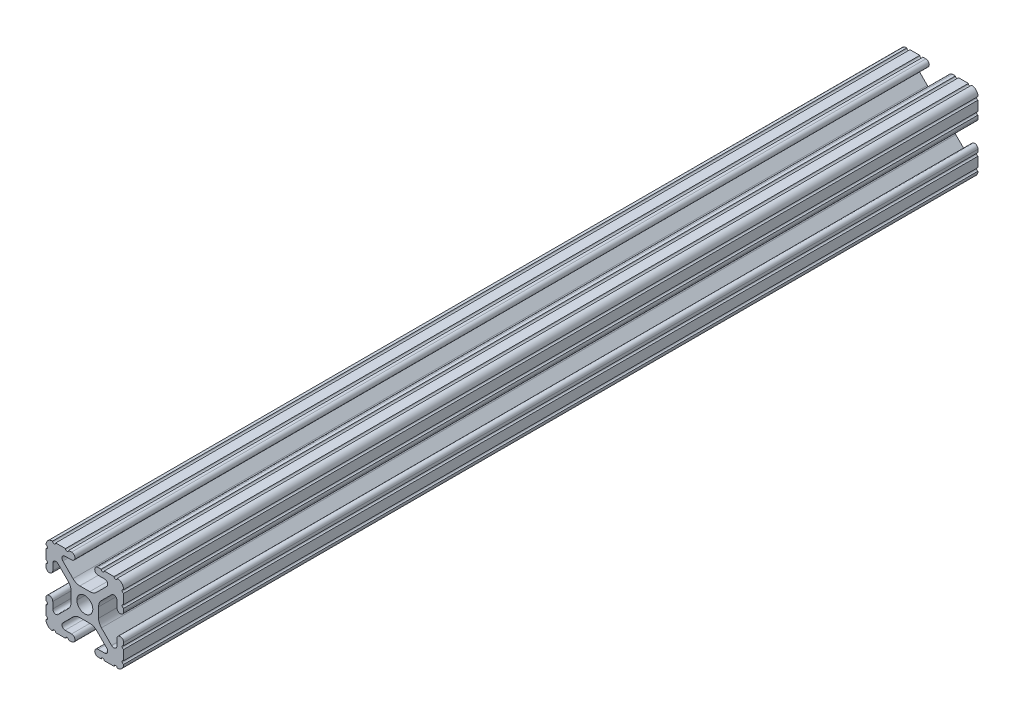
ISO-10303-21;
HEADER;
FILE_DESCRIPTION(('STEP AP214'),'2;1');
FILE_NAME('part.step','',(''),(''),'','','');
FILE_SCHEMA(('AUTOMOTIVE_DESIGN { 1 0 10303 214 1 1 1 1 }'));
ENDSEC;
DATA;
#1=APPLICATION_CONTEXT('core data for automotive mechanical design processes');
#2=APPLICATION_PROTOCOL_DEFINITION('international standard','automotive_design',2000,#1);
#3=PRODUCT_CONTEXT('',#1,'mechanical');
#4=PRODUCT('Part','Part','',(#3));
#5=PRODUCT_RELATED_PRODUCT_CATEGORY('part','',(#4));
#6=PRODUCT_DEFINITION_FORMATION('','',#4);
#7=PRODUCT_DEFINITION_CONTEXT('part definition',#1,'design');
#8=PRODUCT_DEFINITION('design','',#6,#7);
#9=PRODUCT_DEFINITION_SHAPE('','',#8);
#10=(LENGTH_UNIT() NAMED_UNIT(*) SI_UNIT(.MILLI.,.METRE.));
#11=(NAMED_UNIT(*) PLANE_ANGLE_UNIT() SI_UNIT($,.RADIAN.));
#12=(NAMED_UNIT(*) SI_UNIT($,.STERADIAN.) SOLID_ANGLE_UNIT());
#13=UNCERTAINTY_MEASURE_WITH_UNIT(LENGTH_MEASURE(1.E-05),#10,'distance_accuracy_value','');
#14=(GEOMETRIC_REPRESENTATION_CONTEXT(3) GLOBAL_UNCERTAINTY_ASSIGNED_CONTEXT((#13)) GLOBAL_UNIT_ASSIGNED_CONTEXT((#10,
#11,#12)) REPRESENTATION_CONTEXT('',''));
#15=CARTESIAN_POINT('',(0.,0.,0.));
#16=DIRECTION('',(0.,0.,1.));
#17=DIRECTION('',(1.,0.,0.));
#18=AXIS2_PLACEMENT_3D('',#15,#16,#17);
#19=CARTESIAN_POINT('',(-10.5917999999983,-10.5917999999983,-304.8));
#20=DIRECTION('',(0.,0.,-1.));
#21=DIRECTION('',(0.707106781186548,0.707106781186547,0.));
#22=AXIS2_PLACEMENT_3D('',#19,#20,#21);
#23=CYLINDRICAL_SURFACE('',#22,2.10820000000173);
#24=DIRECTION('',(0.,0.,1.));
#25=VECTOR('',#24,1.);
#26=CARTESIAN_POINT('',(-10.566399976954,-12.699846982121,-304.8));
#27=LINE('',#26,#25);
#28=CARTESIAN_POINT('',(-10.566399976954,-12.699846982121,-304.8));
#29=VERTEX_POINT('',#28);
#30=CARTESIAN_POINT('',(-10.566399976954,-12.699846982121,-25.4));
#31=VERTEX_POINT('',#30);
#32=EDGE_CURVE('E1006',#29,#31,#27,.T.);
#33=ORIENTED_EDGE('',*,*,#32,.T.);
#34=CARTESIAN_POINT('',(-10.5917999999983,-10.5917999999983,-25.4));
#35=DIRECTION('',(0.,0.,1.));
#36=DIRECTION('',(1.,0.,0.));
#37=AXIS2_PLACEMENT_3D('',#34,#35,#36);
#38=CIRCLE('',#37,2.10820000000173);
#39=CARTESIAN_POINT('',(-12.699846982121,-10.566399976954,-25.4));
#40=VERTEX_POINT('',#39);
#41=EDGE_CURVE('E1386',#31,#40,#38,.F.);
#42=ORIENTED_EDGE('',*,*,#41,.T.);
#43=DIRECTION('',(0.,0.,1.));
#44=VECTOR('',#43,1.);
#45=CARTESIAN_POINT('',(-12.699846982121,-10.566399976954,-304.8));
#46=LINE('',#45,#44);
#47=CARTESIAN_POINT('',(-12.699846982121,-10.566399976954,-304.8));
#48=VERTEX_POINT('',#47);
#49=EDGE_CURVE('E43',#48,#40,#46,.T.);
#50=ORIENTED_EDGE('',*,*,#49,.F.);
#51=CARTESIAN_POINT('',(-10.5917999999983,-10.5917999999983,-304.8));
#52=DIRECTION('',(0.,0.,1.));
#53=DIRECTION('',(1.,0.,0.));
#54=AXIS2_PLACEMENT_3D('',#51,#52,#53);
#55=CIRCLE('',#54,2.10820000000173);
#56=EDGE_CURVE('E1002',#48,#29,#55,.T.);
#57=ORIENTED_EDGE('',*,*,#56,.T.);
#58=EDGE_LOOP('',(#33,#42,#50,#57));
#59=FACE_BOUND('',#58,.T.);
#60=ADVANCED_FACE('F34',(#59),#23,.T.);
#61=CARTESIAN_POINT('',(-10.0583999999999,-12.6999999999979,-304.8));
#62=DIRECTION('',(0.,0.,-1.));
#63=DIRECTION('',(-0.000150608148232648,-0.999999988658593,0.));
#64=AXIS2_PLACEMENT_3D('',#61,#62,#63);
#65=CYLINDRICAL_SURFACE('',#64,0.507999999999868);
#66=CARTESIAN_POINT('',(-10.0583999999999,-12.6999999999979,-25.4));
#67=DIRECTION('',(0.,0.,1.));
#68=DIRECTION('',(1.,0.,0.));
#69=AXIS2_PLACEMENT_3D('',#66,#67,#68);
#70=CIRCLE('',#69,0.507999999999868);
#71=CARTESIAN_POINT('',(-9.5504,-12.6999999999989,-25.4));
#72=VERTEX_POINT('',#71);
#73=EDGE_CURVE('E58',#31,#72,#70,.F.);
#74=ORIENTED_EDGE('',*,*,#73,.F.);
#75=ORIENTED_EDGE('',*,*,#32,.F.);
#76=CARTESIAN_POINT('',(-10.0583999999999,-12.6999999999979,-304.8));
#77=DIRECTION('',(0.,0.,1.));
#78=DIRECTION('',(1.,0.,0.));
#79=AXIS2_PLACEMENT_3D('',#76,#77,#78);
#80=CIRCLE('',#79,0.507999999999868);
#81=CARTESIAN_POINT('',(-9.5504,-12.6999999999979,-304.8));
#82=VERTEX_POINT('',#81);
#83=EDGE_CURVE('E1015',#82,#29,#80,.T.);
#84=ORIENTED_EDGE('',*,*,#83,.F.);
#85=DIRECTION('',(0.,0.,1.));
#86=VECTOR('',#85,1.);
#87=CARTESIAN_POINT('',(-9.5504,-12.6999999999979,-304.8));
#88=LINE('',#87,#86);
#89=EDGE_CURVE('E1011',#82,#72,#88,.T.);
#90=ORIENTED_EDGE('',*,*,#89,.T.);
#91=EDGE_LOOP('',(#74,#75,#84,#90));
#92=FACE_BOUND('',#91,.T.);
#93=ADVANCED_FACE('F974',(#92),#65,.F.);
#94=CARTESIAN_POINT('',(0.,0.,-304.8));
#95=DIRECTION('',(0.,0.,-1.));
#96=DIRECTION('',(0.,1.,0.));
#97=AXIS2_PLACEMENT_3D('',#94,#95,#96);
#98=CYLINDRICAL_SURFACE('',#97,2.6035);
#99=CARTESIAN_POINT('',(0.,0.,-25.4));
#100=DIRECTION('',(0.,0.,1.));
#101=DIRECTION('',(1.,0.,0.));
#102=AXIS2_PLACEMENT_3D('',#99,#100,#101);
#103=CIRCLE('',#102,2.6035);
#104=CARTESIAN_POINT('',(2.6035,0.,-25.4));
#105=VERTEX_POINT('',#104);
#106=CARTESIAN_POINT('',(-2.6035,0.,-25.4));
#107=VERTEX_POINT('',#106);
#108=EDGE_CURVE('E50',#105,#107,#103,.F.);
#109=ORIENTED_EDGE('',*,*,#108,.F.);
#110=CARTESIAN_POINT('',(2.6035,0.,-25.4));
#111=DIRECTION('',(0.,0.,-1.));
#112=VECTOR('',#111,1.);
#113=LINE('',#110,#112);
#114=CARTESIAN_POINT('',(2.6035,0.,-304.8));
#115=VERTEX_POINT('',#114);
#116=EDGE_CURVE('E947',#105,#115,#113,.T.);
#117=ORIENTED_EDGE('',*,*,#116,.T.);
#118=CARTESIAN_POINT('',(0.,0.,-304.8));
#119=DIRECTION('',(0.,0.,1.));
#120=DIRECTION('',(1.,0.,0.));
#121=AXIS2_PLACEMENT_3D('',#118,#119,#120);
#122=CIRCLE('',#121,2.6035);
#123=CARTESIAN_POINT('',(-2.6035,0.,-304.8));
#124=VERTEX_POINT('',#123);
#125=EDGE_CURVE('E1381',#124,#115,#122,.T.);
#126=ORIENTED_EDGE('',*,*,#125,.F.);
#127=CARTESIAN_POINT('',(-2.6035,0.,-25.4));
#128=DIRECTION('',(0.,0.,-1.));
#129=VECTOR('',#128,1.);
#130=LINE('',#127,#129);
#131=EDGE_CURVE('E994',#107,#124,#130,.T.);
#132=ORIENTED_EDGE('',*,*,#131,.F.);
#133=EDGE_LOOP('',(#109,#117,#126,#132));
#134=FACE_BOUND('',#133,.T.);
#135=ADVANCED_FACE('F967',(#134),#98,.F.);
#136=CARTESIAN_POINT('',(0.,0.,-304.8));
#137=DIRECTION('',(0.,0.,-1.));
#138=DIRECTION('',(0.,-1.,0.));
#139=AXIS2_PLACEMENT_3D('',#136,#137,#138);
#140=CYLINDRICAL_SURFACE('',#139,2.6035);
#141=CARTESIAN_POINT('',(0.,0.,-25.4));
#142=DIRECTION('',(0.,0.,1.));
#143=DIRECTION('',(1.,0.,0.));
#144=AXIS2_PLACEMENT_3D('',#141,#142,#143);
#145=CIRCLE('',#144,2.6035);
#146=EDGE_CURVE('E566',#107,#105,#145,.F.);
#147=ORIENTED_EDGE('',*,*,#146,.F.);
#148=ORIENTED_EDGE('',*,*,#131,.T.);
#149=CARTESIAN_POINT('',(0.,0.,-304.8));
#150=DIRECTION('',(0.,0.,1.));
#151=DIRECTION('',(1.,0.,0.));
#152=AXIS2_PLACEMENT_3D('',#149,#150,#151);
#153=CIRCLE('',#152,2.6035);
#154=EDGE_CURVE('E1377',#115,#124,#153,.T.);
#155=ORIENTED_EDGE('',*,*,#154,.F.);
#156=ORIENTED_EDGE('',*,*,#116,.F.);
#157=EDGE_LOOP('',(#147,#148,#155,#156));
#158=FACE_BOUND('',#157,.T.);
#159=ADVANCED_FACE('F956',(#158),#140,.F.);
#160=CARTESIAN_POINT('',(-12.7,-6.3330836,-304.8));
#161=DIRECTION('',(-1.,0.,0.));
#162=DIRECTION('',(0.,0.,1.));
#163=AXIS2_PLACEMENT_3D('',#160,#161,#162);
#164=PLANE('',#163);
#165=DIRECTION('',(0.,0.,1.));
#166=VECTOR('',#165,1.);
#167=CARTESIAN_POINT('',(-12.7,-9.5504,-304.8));
#168=LINE('',#167,#166);
#169=CARTESIAN_POINT('',(-12.7,-9.5504,-304.8));
#170=VERTEX_POINT('',#169);
#171=CARTESIAN_POINT('',(-12.7,-9.5504,-25.4));
#172=VERTEX_POINT('',#171);
#173=EDGE_CURVE('E937',#170,#172,#168,.T.);
#174=ORIENTED_EDGE('',*,*,#173,.T.);
#175=DIRECTION('',(0.,1.,0.));
#176=VECTOR('',#175,1.);
#177=CARTESIAN_POINT('',(-12.7,-6.3330836,-25.4));
#178=LINE('',#177,#176);
#179=CARTESIAN_POINT('',(-12.7,-6.3330836,-25.4));
#180=VERTEX_POINT('',#179);
#181=EDGE_CURVE('E1394',#172,#180,#178,.T.);
#182=ORIENTED_EDGE('',*,*,#181,.T.);
#183=DIRECTION('',(0.,0.,1.));
#184=VECTOR('',#183,1.);
#185=CARTESIAN_POINT('',(-12.7,-6.3330836,-304.8));
#186=LINE('',#185,#184);
#187=CARTESIAN_POINT('',(-12.7,-6.3330836,-304.8));
#188=VERTEX_POINT('',#187);
#189=EDGE_CURVE('E942',#188,#180,#186,.T.);
#190=ORIENTED_EDGE('',*,*,#189,.F.);
#191=DIRECTION('',(0.,-1.,0.));
#192=VECTOR('',#191,1.);
#193=CARTESIAN_POINT('',(-12.7,-6.3330836,-304.8));
#194=LINE('',#193,#192);
#195=EDGE_CURVE('E1024',#188,#170,#194,.T.);
#196=ORIENTED_EDGE('',*,*,#195,.T.);
#197=EDGE_LOOP('',(#174,#182,#190,#196));
#198=FACE_BOUND('',#197,.T.);
#199=ADVANCED_FACE('F966',(#198),#164,.T.);
#200=CARTESIAN_POINT('',(-12.6999999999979,-10.0583999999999,-304.8));
#201=DIRECTION('',(0.,0.,-1.));
#202=DIRECTION('',(-0.999999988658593,-0.00015060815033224,0.));
#203=AXIS2_PLACEMENT_3D('',#200,#201,#202);
#204=CYLINDRICAL_SURFACE('',#203,0.50799999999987);
#205=CARTESIAN_POINT('',(-12.6999999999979,-10.0583999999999,-25.4));
#206=DIRECTION('',(0.,0.,1.));
#207=DIRECTION('',(1.,0.,0.));
#208=AXIS2_PLACEMENT_3D('',#205,#206,#207);
#209=CIRCLE('',#208,0.50799999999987);
#210=EDGE_CURVE('E1384',#172,#40,#209,.F.);
#211=ORIENTED_EDGE('',*,*,#210,.F.);
#212=ORIENTED_EDGE('',*,*,#173,.F.);
#213=CARTESIAN_POINT('',(-12.6999999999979,-10.0583999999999,-304.8));
#214=DIRECTION('',(0.,0.,1.));
#215=DIRECTION('',(1.,0.,0.));
#216=AXIS2_PLACEMENT_3D('',#213,#214,#215);
#217=CIRCLE('',#216,0.50799999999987);
#218=EDGE_CURVE('E1020',#48,#170,#217,.T.);
#219=ORIENTED_EDGE('',*,*,#218,.F.);
#220=ORIENTED_EDGE('',*,*,#49,.T.);
#221=EDGE_LOOP('',(#211,#212,#219,#220));
#222=FACE_BOUND('',#221,.T.);
#223=ADVANCED_FACE('F1871',(#222),#204,.F.);
#224=CARTESIAN_POINT('',(-12.699999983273,-5.8250836,-304.8));
#225=DIRECTION('',(0.,0.,-1.));
#226=DIRECTION('',(-1.,0.,0.));
#227=AXIS2_PLACEMENT_3D('',#224,#225,#226);
#228=CYLINDRICAL_SURFACE('',#227,0.508);
#229=CARTESIAN_POINT('',(-12.699999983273,-5.8250836,-25.4));
#230=DIRECTION('',(0.,0.,1.));
#231=DIRECTION('',(1.,0.,0.));
#232=AXIS2_PLACEMENT_3D('',#229,#230,#231);
#233=CIRCLE('',#232,0.508);
#234=CARTESIAN_POINT('',(-12.7,-5.3170836,-25.4));
#235=VERTEX_POINT('',#234);
#236=EDGE_CURVE('E1397',#235,#180,#233,.F.);
#237=ORIENTED_EDGE('',*,*,#236,.F.);
#238=DIRECTION('',(0.,0.,1.));
#239=VECTOR('',#238,1.);
#240=CARTESIAN_POINT('',(-12.7,-5.3170836,-304.8));
#241=LINE('',#240,#239);
#242=CARTESIAN_POINT('',(-12.7,-5.3170836,-304.8));
#243=VERTEX_POINT('',#242);
#244=EDGE_CURVE('E932',#243,#235,#241,.T.);
#245=ORIENTED_EDGE('',*,*,#244,.F.);
#246=CARTESIAN_POINT('',(-12.699999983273,-5.8250836,-304.8));
#247=DIRECTION('',(0.,0.,1.));
#248=DIRECTION('',(1.,0.,0.));
#249=AXIS2_PLACEMENT_3D('',#246,#247,#248);
#250=CIRCLE('',#249,0.508);
#251=EDGE_CURVE('E1029',#188,#243,#250,.T.);
#252=ORIENTED_EDGE('',*,*,#251,.F.);
#253=ORIENTED_EDGE('',*,*,#189,.T.);
#254=EDGE_LOOP('',(#237,#245,#252,#253));
#255=FACE_BOUND('',#254,.T.);
#256=ADVANCED_FACE('F1864',(#255),#228,.F.);
#257=CARTESIAN_POINT('',(-12.7,-4.3434,-304.8));
#258=DIRECTION('',(-1.,0.,0.));
#259=DIRECTION('',(0.,0.,1.));
#260=AXIS2_PLACEMENT_3D('',#257,#258,#259);
#261=PLANE('',#260);
#262=ORIENTED_EDGE('',*,*,#244,.T.);
#263=DIRECTION('',(0.,1.,0.));
#264=VECTOR('',#263,1.);
#265=CARTESIAN_POINT('',(-12.7,-4.3434,-25.4));
#266=LINE('',#265,#264);
#267=CARTESIAN_POINT('',(-12.7,-4.3434,-25.4));
#268=VERTEX_POINT('',#267);
#269=EDGE_CURVE('E1399',#235,#268,#266,.T.);
#270=ORIENTED_EDGE('',*,*,#269,.T.);
#271=DIRECTION('',(0.,0.,1.));
#272=VECTOR('',#271,1.);
#273=CARTESIAN_POINT('',(-12.7,-4.3434,-304.8));
#274=LINE('',#273,#272);
#275=CARTESIAN_POINT('',(-12.7,-4.3434,-304.8));
#276=VERTEX_POINT('',#275);
#277=EDGE_CURVE('E927',#276,#268,#274,.T.);
#278=ORIENTED_EDGE('',*,*,#277,.F.);
#279=DIRECTION('',(0.,-1.,0.));
#280=VECTOR('',#279,1.);
#281=CARTESIAN_POINT('',(-12.7,-4.3434,-304.8));
#282=LINE('',#281,#280);
#283=EDGE_CURVE('E1033',#276,#243,#282,.T.);
#284=ORIENTED_EDGE('',*,*,#283,.T.);
#285=EDGE_LOOP('',(#262,#270,#278,#284));
#286=FACE_BOUND('',#285,.T.);
#287=ADVANCED_FACE('F1860',(#286),#261,.T.);
#288=CARTESIAN_POINT('',(-11.5951,-4.3434,-304.8));
#289=DIRECTION('',(0.,0.,-1.));
#290=DIRECTION('',(0.,-1.,0.));
#291=AXIS2_PLACEMENT_3D('',#288,#289,#290);
#292=CYLINDRICAL_SURFACE('',#291,1.1049);
#293=ORIENTED_EDGE('',*,*,#277,.T.);
#294=CARTESIAN_POINT('',(-11.5951,-4.3434,-25.4));
#295=DIRECTION('',(0.,0.,1.));
#296=DIRECTION('',(1.,0.,0.));
#297=AXIS2_PLACEMENT_3D('',#294,#295,#296);
#298=CIRCLE('',#297,1.1049);
#299=CARTESIAN_POINT('',(-10.4902,-4.3434,-25.4));
#300=VERTEX_POINT('',#299);
#301=EDGE_CURVE('E1402',#268,#300,#298,.F.);
#302=ORIENTED_EDGE('',*,*,#301,.T.);
#303=DIRECTION('',(0.,0.,1.));
#304=VECTOR('',#303,1.);
#305=CARTESIAN_POINT('',(-10.4902,-4.3434,-304.8));
#306=LINE('',#305,#304);
#307=CARTESIAN_POINT('',(-10.4902,-4.3434,-304.8));
#308=VERTEX_POINT('',#307);
#309=EDGE_CURVE('E922',#308,#300,#306,.T.);
#310=ORIENTED_EDGE('',*,*,#309,.F.);
#311=CARTESIAN_POINT('',(-11.5951,-4.3434,-304.8));
#312=DIRECTION('',(0.,0.,1.));
#313=DIRECTION('',(1.,0.,0.));
#314=AXIS2_PLACEMENT_3D('',#311,#312,#313);
#315=CIRCLE('',#314,1.1049);
#316=EDGE_CURVE('E1038',#308,#276,#315,.T.);
#317=ORIENTED_EDGE('',*,*,#316,.T.);
#318=EDGE_LOOP('',(#293,#302,#310,#317));
#319=FACE_BOUND('',#318,.T.);
#320=ADVANCED_FACE('F1857',(#319),#292,.T.);
#321=CARTESIAN_POINT('',(-10.4902,-6.47479445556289,-304.8));
#322=DIRECTION('',(1.,0.,0.));
#323=DIRECTION('',(0.,0.,-1.));
#324=AXIS2_PLACEMENT_3D('',#321,#322,#323);
#325=PLANE('',#324);
#326=ORIENTED_EDGE('',*,*,#309,.T.);
#327=DIRECTION('',(0.,-1.,0.));
#328=VECTOR('',#327,1.);
#329=CARTESIAN_POINT('',(-10.4902,-6.47479445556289,-25.4));
#330=LINE('',#329,#328);
#331=CARTESIAN_POINT('',(-10.4902,-6.47479445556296,-25.4));
#332=VERTEX_POINT('',#331);
#333=EDGE_CURVE('E1405',#300,#332,#330,.T.);
#334=ORIENTED_EDGE('',*,*,#333,.T.);
#335=DIRECTION('',(0.,0.,1.));
#336=VECTOR('',#335,1.);
#337=CARTESIAN_POINT('',(-10.4902,-6.47479445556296,-304.8));
#338=LINE('',#337,#336);
#339=CARTESIAN_POINT('',(-10.4902,-6.47479445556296,-304.8));
#340=VERTEX_POINT('',#339);
#341=EDGE_CURVE('E917',#340,#332,#338,.T.);
#342=ORIENTED_EDGE('',*,*,#341,.F.);
#343=DIRECTION('',(0.,1.,0.));
#344=VECTOR('',#343,1.);
#345=CARTESIAN_POINT('',(-10.4902,-6.47479445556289,-304.8));
#346=LINE('',#345,#344);
#347=EDGE_CURVE('E1043',#340,#308,#346,.T.);
#348=ORIENTED_EDGE('',*,*,#347,.T.);
#349=EDGE_LOOP('',(#326,#334,#342,#348));
#350=FACE_BOUND('',#349,.T.);
#351=ADVANCED_FACE('F1854',(#350),#325,.T.);
#352=CARTESIAN_POINT('',(-9.47420000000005,-6.47479445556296,-304.8));
#353=DIRECTION('',(0.,0.,-1.));
#354=DIRECTION('',(0.382683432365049,0.923879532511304,0.));
#355=AXIS2_PLACEMENT_3D('',#352,#353,#354);
#356=CYLINDRICAL_SURFACE('',#355,1.01599999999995);
#357=CARTESIAN_POINT('',(-9.47420000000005,-6.47479445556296,-25.4));
#358=DIRECTION('',(0.,0.,1.));
#359=DIRECTION('',(1.,0.,0.));
#360=AXIS2_PLACEMENT_3D('',#357,#358,#359);
#361=CIRCLE('',#360,1.01599999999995);
#362=CARTESIAN_POINT('',(-8.75577951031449,-7.1932149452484,-25.4));
#363=VERTEX_POINT('',#362);
#364=EDGE_CURVE('E1408',#363,#332,#361,.F.);
#365=ORIENTED_EDGE('',*,*,#364,.F.);
#366=DIRECTION('',(0.,0.,1.));
#367=VECTOR('',#366,1.);
#368=CARTESIAN_POINT('',(-8.75577951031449,-7.1932149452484,-304.8));
#369=LINE('',#368,#367);
#370=CARTESIAN_POINT('',(-8.75577951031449,-7.1932149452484,-304.8));
#371=VERTEX_POINT('',#370);
#372=EDGE_CURVE('E912',#371,#363,#369,.T.);
#373=ORIENTED_EDGE('',*,*,#372,.F.);
#374=CARTESIAN_POINT('',(-9.47420000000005,-6.47479445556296,-304.8));
#375=DIRECTION('',(0.,0.,1.));
#376=DIRECTION('',(1.,0.,0.));
#377=AXIS2_PLACEMENT_3D('',#374,#375,#376);
#378=CIRCLE('',#377,1.01599999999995);
#379=EDGE_CURVE('E1048',#340,#371,#378,.T.);
#380=ORIENTED_EDGE('',*,*,#379,.F.);
#381=ORIENTED_EDGE('',*,*,#341,.T.);
#382=EDGE_LOOP('',(#365,#373,#380,#381));
#383=FACE_BOUND('',#382,.T.);
#384=ADVANCED_FACE('F1850',(#383),#356,.F.);
#385=CARTESIAN_POINT('',(-5.4257359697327,-3.86317140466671,-304.8));
#386=DIRECTION('',(-0.707106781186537,0.707106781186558,0.));
#387=DIRECTION('',(-0.707106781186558,-0.707106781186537,0.));
#388=AXIS2_PLACEMENT_3D('',#385,#386,#387);
#389=PLANE('',#388);
#390=ORIENTED_EDGE('',*,*,#372,.T.);
#391=DIRECTION('',(0.707106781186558,0.707106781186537,0.));
#392=VECTOR('',#391,1.);
#393=CARTESIAN_POINT('',(-5.4257359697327,-3.86317140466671,-25.4));
#394=LINE('',#393,#392);
#395=CARTESIAN_POINT('',(-5.4257359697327,-3.86317140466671,-25.4));
#396=VERTEX_POINT('',#395);
#397=EDGE_CURVE('E1410',#363,#396,#394,.T.);
#398=ORIENTED_EDGE('',*,*,#397,.T.);
#399=DIRECTION('',(0.,0.,1.));
#400=VECTOR('',#399,1.);
#401=CARTESIAN_POINT('',(-5.4257359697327,-3.86317140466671,-304.8));
#402=LINE('',#401,#400);
#403=CARTESIAN_POINT('',(-5.4257359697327,-3.86317140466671,-304.8));
#404=VERTEX_POINT('',#403);
#405=EDGE_CURVE('E907',#404,#396,#402,.T.);
#406=ORIENTED_EDGE('',*,*,#405,.F.);
#407=DIRECTION('',(-0.707106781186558,-0.707106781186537,0.));
#408=VECTOR('',#407,1.);
#409=CARTESIAN_POINT('',(-5.4257359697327,-3.86317140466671,-304.8));
#410=LINE('',#409,#408);
#411=EDGE_CURVE('E1052',#404,#371,#410,.T.);
#412=ORIENTED_EDGE('',*,*,#411,.T.);
#413=EDGE_LOOP('',(#390,#398,#406,#412));
#414=FACE_BOUND('',#413,.T.);
#415=ADVANCED_FACE('F1846',(#414),#389,.T.);
#416=CARTESIAN_POINT('',(-7.67080000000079,-1.6181073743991,-304.8));
#417=DIRECTION('',(0.,0.,-1.));
#418=DIRECTION('',(-0.923879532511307,0.38268343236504,0.));
#419=AXIS2_PLACEMENT_3D('',#416,#417,#418);
#420=CYLINDRICAL_SURFACE('',#419,3.17500000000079);
#421=CARTESIAN_POINT('',(-7.67080000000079,-1.6181073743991,-25.4));
#422=DIRECTION('',(0.,0.,1.));
#423=DIRECTION('',(1.,0.,0.));
#424=AXIS2_PLACEMENT_3D('',#421,#422,#423);
#425=CIRCLE('',#424,3.17500000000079);
#426=CARTESIAN_POINT('',(-4.4958,-1.6181073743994,-25.4));
#427=VERTEX_POINT('',#426);
#428=EDGE_CURVE('E1413',#427,#396,#425,.F.);
#429=ORIENTED_EDGE('',*,*,#428,.F.);
#430=DIRECTION('',(0.,0.,1.));
#431=VECTOR('',#430,1.);
#432=CARTESIAN_POINT('',(-4.4958,-1.6181073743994,-304.8));
#433=LINE('',#432,#431);
#434=CARTESIAN_POINT('',(-4.4958,-1.6181073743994,-304.8));
#435=VERTEX_POINT('',#434);
#436=EDGE_CURVE('E902',#435,#427,#433,.T.);
#437=ORIENTED_EDGE('',*,*,#436,.F.);
#438=CARTESIAN_POINT('',(-7.67080000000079,-1.6181073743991,-304.8));
#439=DIRECTION('',(0.,0.,1.));
#440=DIRECTION('',(1.,0.,0.));
#441=AXIS2_PLACEMENT_3D('',#438,#439,#440);
#442=CIRCLE('',#441,3.17500000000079);
#443=EDGE_CURVE('E1057',#404,#435,#442,.T.);
#444=ORIENTED_EDGE('',*,*,#443,.F.);
#445=ORIENTED_EDGE('',*,*,#405,.T.);
#446=EDGE_LOOP('',(#429,#437,#444,#445));
#447=FACE_BOUND('',#446,.T.);
#448=ADVANCED_FACE('F1842',(#447),#420,.F.);
#449=CARTESIAN_POINT('',(-4.4958,1.6181073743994,-304.8));
#450=DIRECTION('',(-1.,0.,0.));
#451=DIRECTION('',(0.,0.,1.));
#452=AXIS2_PLACEMENT_3D('',#449,#450,#451);
#453=PLANE('',#452);
#454=ORIENTED_EDGE('',*,*,#436,.T.);
#455=DIRECTION('',(0.,1.,0.));
#456=VECTOR('',#455,1.);
#457=CARTESIAN_POINT('',(-4.4958,1.6181073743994,-25.4));
#458=LINE('',#457,#456);
#459=CARTESIAN_POINT('',(-4.4958,1.61810737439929,-25.4));
#460=VERTEX_POINT('',#459);
#461=EDGE_CURVE('E1415',#427,#460,#458,.T.);
#462=ORIENTED_EDGE('',*,*,#461,.T.);
#463=DIRECTION('',(0.,0.,1.));
#464=VECTOR('',#463,1.);
#465=CARTESIAN_POINT('',(-4.4958,1.61810737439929,-304.8));
#466=LINE('',#465,#464);
#467=CARTESIAN_POINT('',(-4.4958,1.61810737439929,-304.8));
#468=VERTEX_POINT('',#467);
#469=EDGE_CURVE('E897',#468,#460,#466,.T.);
#470=ORIENTED_EDGE('',*,*,#469,.F.);
#471=DIRECTION('',(0.,-1.,0.));
#472=VECTOR('',#471,1.);
#473=CARTESIAN_POINT('',(-4.4958,1.6181073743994,-304.8));
#474=LINE('',#473,#472);
#475=EDGE_CURVE('E1061',#468,#435,#474,.T.);
#476=ORIENTED_EDGE('',*,*,#475,.T.);
#477=EDGE_LOOP('',(#454,#462,#470,#476));
#478=FACE_BOUND('',#477,.T.);
#479=ADVANCED_FACE('F1838',(#478),#453,.T.);
#480=CARTESIAN_POINT('',(-7.67080000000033,1.61810737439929,-304.8));
#481=DIRECTION('',(0.,0.,-1.));
#482=DIRECTION('',(-0.923879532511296,-0.382683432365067,0.));
#483=AXIS2_PLACEMENT_3D('',#480,#481,#482);
#484=CYLINDRICAL_SURFACE('',#483,3.17500000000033);
#485=CARTESIAN_POINT('',(-7.67080000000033,1.61810737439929,-25.4));
#486=DIRECTION('',(0.,0.,1.));
#487=DIRECTION('',(1.,0.,0.));
#488=AXIS2_PLACEMENT_3D('',#485,#486,#487);
#489=CIRCLE('',#488,3.17500000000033);
#490=CARTESIAN_POINT('',(-5.4257359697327,3.8631714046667,-25.4));
#491=VERTEX_POINT('',#490);
#492=EDGE_CURVE('E1418',#491,#460,#489,.F.);
#493=ORIENTED_EDGE('',*,*,#492,.F.);
#494=DIRECTION('',(0.,0.,1.));
#495=VECTOR('',#494,1.);
#496=CARTESIAN_POINT('',(-5.4257359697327,3.86317140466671,-304.8));
#497=LINE('',#496,#495);
#498=CARTESIAN_POINT('',(-5.4257359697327,3.86317140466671,-304.8));
#499=VERTEX_POINT('',#498);
#500=EDGE_CURVE('E892',#499,#491,#497,.T.);
#501=ORIENTED_EDGE('',*,*,#500,.F.);
#502=CARTESIAN_POINT('',(-7.67080000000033,1.61810737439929,-304.8));
#503=DIRECTION('',(0.,0.,1.));
#504=DIRECTION('',(1.,0.,0.));
#505=AXIS2_PLACEMENT_3D('',#502,#503,#504);
#506=CIRCLE('',#505,3.17500000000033);
#507=EDGE_CURVE('E1066',#468,#499,#506,.T.);
#508=ORIENTED_EDGE('',*,*,#507,.F.);
#509=ORIENTED_EDGE('',*,*,#469,.T.);
#510=EDGE_LOOP('',(#493,#501,#508,#509));
#511=FACE_BOUND('',#510,.T.);
#512=ADVANCED_FACE('F1834',(#511),#484,.F.);
#513=CARTESIAN_POINT('',(-8.75577951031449,7.1932149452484,-304.8));
#514=DIRECTION('',(-0.707106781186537,-0.707106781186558,0.));
#515=DIRECTION('',(0.707106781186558,-0.707106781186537,0.));
#516=AXIS2_PLACEMENT_3D('',#513,#514,#515);
#517=PLANE('',#516);
#518=ORIENTED_EDGE('',*,*,#500,.T.);
#519=DIRECTION('',(-0.707106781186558,0.707106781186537,0.));
#520=VECTOR('',#519,1.);
#521=CARTESIAN_POINT('',(-8.75577951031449,7.1932149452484,-25.4));
#522=LINE('',#521,#520);
#523=CARTESIAN_POINT('',(-8.75577951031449,7.1932149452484,-25.4));
#524=VERTEX_POINT('',#523);
#525=EDGE_CURVE('E1420',#491,#524,#522,.T.);
#526=ORIENTED_EDGE('',*,*,#525,.T.);
#527=DIRECTION('',(0.,0.,1.));
#528=VECTOR('',#527,1.);
#529=CARTESIAN_POINT('',(-8.75577951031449,7.1932149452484,-304.8));
#530=LINE('',#529,#528);
#531=CARTESIAN_POINT('',(-8.75577951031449,7.1932149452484,-304.8));
#532=VERTEX_POINT('',#531);
#533=EDGE_CURVE('E887',#532,#524,#530,.T.);
#534=ORIENTED_EDGE('',*,*,#533,.F.);
#535=DIRECTION('',(0.707106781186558,-0.707106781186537,0.));
#536=VECTOR('',#535,1.);
#537=CARTESIAN_POINT('',(-8.75577951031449,7.1932149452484,-304.8));
#538=LINE('',#537,#536);
#539=EDGE_CURVE('E1070',#532,#499,#538,.T.);
#540=ORIENTED_EDGE('',*,*,#539,.T.);
#541=EDGE_LOOP('',(#518,#526,#534,#540));
#542=FACE_BOUND('',#541,.T.);
#543=ADVANCED_FACE('F1830',(#542),#517,.T.);
#544=CARTESIAN_POINT('',(-9.47420000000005,6.47479445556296,-304.8));
#545=DIRECTION('',(0.,0.,-1.));
#546=DIRECTION('',(0.382683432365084,-0.923879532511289,0.));
#547=AXIS2_PLACEMENT_3D('',#544,#545,#546);
#548=CYLINDRICAL_SURFACE('',#547,1.01599999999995);
#549=CARTESIAN_POINT('',(-9.47420000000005,6.47479445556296,-25.4));
#550=DIRECTION('',(0.,0.,1.));
#551=DIRECTION('',(1.,0.,0.));
#552=AXIS2_PLACEMENT_3D('',#549,#550,#551);
#553=CIRCLE('',#552,1.01599999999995);
#554=CARTESIAN_POINT('',(-10.4902,6.47479445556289,-25.4));
#555=VERTEX_POINT('',#554);
#556=EDGE_CURVE('E1423',#555,#524,#553,.F.);
#557=ORIENTED_EDGE('',*,*,#556,.F.);
#558=DIRECTION('',(0.,0.,1.));
#559=VECTOR('',#558,1.);
#560=CARTESIAN_POINT('',(-10.4902,6.47479445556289,-304.8));
#561=LINE('',#560,#559);
#562=CARTESIAN_POINT('',(-10.4902,6.47479445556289,-304.8));
#563=VERTEX_POINT('',#562);
#564=EDGE_CURVE('E882',#563,#555,#561,.T.);
#565=ORIENTED_EDGE('',*,*,#564,.F.);
#566=CARTESIAN_POINT('',(-9.47420000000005,6.47479445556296,-304.8));
#567=DIRECTION('',(0.,0.,1.));
#568=DIRECTION('',(1.,0.,0.));
#569=AXIS2_PLACEMENT_3D('',#566,#567,#568);
#570=CIRCLE('',#569,1.01599999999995);
#571=EDGE_CURVE('E1075',#532,#563,#570,.T.);
#572=ORIENTED_EDGE('',*,*,#571,.F.);
#573=ORIENTED_EDGE('',*,*,#533,.T.);
#574=EDGE_LOOP('',(#557,#565,#572,#573));
#575=FACE_BOUND('',#574,.T.);
#576=ADVANCED_FACE('F1826',(#575),#548,.F.);
#577=CARTESIAN_POINT('',(-10.4902,4.3434,-304.8));
#578=DIRECTION('',(1.,0.,0.));
#579=DIRECTION('',(0.,0.,-1.));
#580=AXIS2_PLACEMENT_3D('',#577,#578,#579);
#581=PLANE('',#580);
#582=ORIENTED_EDGE('',*,*,#564,.T.);
#583=DIRECTION('',(0.,-1.,0.));
#584=VECTOR('',#583,1.);
#585=CARTESIAN_POINT('',(-10.4902,4.3434,-25.4));
#586=LINE('',#585,#584);
#587=CARTESIAN_POINT('',(-10.4902,4.34339999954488,-25.4));
#588=VERTEX_POINT('',#587);
#589=EDGE_CURVE('E1425',#555,#588,#586,.T.);
#590=ORIENTED_EDGE('',*,*,#589,.T.);
#591=DIRECTION('',(0.,0.,1.));
#592=VECTOR('',#591,1.);
#593=CARTESIAN_POINT('',(-10.4902,4.34339999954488,-304.8));
#594=LINE('',#593,#592);
#595=CARTESIAN_POINT('',(-10.4902,4.34339999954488,-304.8));
#596=VERTEX_POINT('',#595);
#597=EDGE_CURVE('E877',#596,#588,#594,.T.);
#598=ORIENTED_EDGE('',*,*,#597,.F.);
#599=DIRECTION('',(0.,1.,0.));
#600=VECTOR('',#599,1.);
#601=CARTESIAN_POINT('',(-10.4902,4.3434,-304.8));
#602=LINE('',#601,#600);
#603=EDGE_CURVE('E1079',#596,#563,#602,.T.);
#604=ORIENTED_EDGE('',*,*,#603,.T.);
#605=EDGE_LOOP('',(#582,#590,#598,#604));
#606=FACE_BOUND('',#605,.T.);
#607=ADVANCED_FACE('F1822',(#606),#581,.T.);
#608=CARTESIAN_POINT('',(-11.5951,4.3433999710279,-304.8));
#609=DIRECTION('',(0.,0.,-1.));
#610=DIRECTION('',(-2.12315225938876E-09,1.,0.));
#611=AXIS2_PLACEMENT_3D('',#608,#609,#610);
#612=CYLINDRICAL_SURFACE('',#611,1.1049);
#613=ORIENTED_EDGE('',*,*,#597,.T.);
#614=CARTESIAN_POINT('',(-11.5951,4.3433999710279,-25.4));
#615=DIRECTION('',(0.,0.,1.));
#616=DIRECTION('',(1.,0.,0.));
#617=AXIS2_PLACEMENT_3D('',#614,#615,#616);
#618=CIRCLE('',#617,1.1049);
#619=CARTESIAN_POINT('',(-12.7,4.3434,-25.4));
#620=VERTEX_POINT('',#619);
#621=EDGE_CURVE('E1428',#588,#620,#618,.F.);
#622=ORIENTED_EDGE('',*,*,#621,.T.);
#623=DIRECTION('',(0.,0.,1.));
#624=VECTOR('',#623,1.);
#625=CARTESIAN_POINT('',(-12.7,4.3434,-304.8));
#626=LINE('',#625,#624);
#627=CARTESIAN_POINT('',(-12.7,4.3434,-304.8));
#628=VERTEX_POINT('',#627);
#629=EDGE_CURVE('E872',#628,#620,#626,.T.);
#630=ORIENTED_EDGE('',*,*,#629,.F.);
#631=CARTESIAN_POINT('',(-11.5951,4.3433999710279,-304.8));
#632=DIRECTION('',(0.,0.,1.));
#633=DIRECTION('',(1.,0.,0.));
#634=AXIS2_PLACEMENT_3D('',#631,#632,#633);
#635=CIRCLE('',#634,1.1049);
#636=EDGE_CURVE('E1084',#628,#596,#635,.T.);
#637=ORIENTED_EDGE('',*,*,#636,.T.);
#638=EDGE_LOOP('',(#613,#622,#630,#637));
#639=FACE_BOUND('',#638,.T.);
#640=ADVANCED_FACE('F1819',(#639),#612,.T.);
#641=CARTESIAN_POINT('',(-12.7,5.3170836,-304.8));
#642=DIRECTION('',(-1.,0.,0.));
#643=DIRECTION('',(0.,0.,1.));
#644=AXIS2_PLACEMENT_3D('',#641,#642,#643);
#645=PLANE('',#644);
#646=ORIENTED_EDGE('',*,*,#629,.T.);
#647=DIRECTION('',(0.,1.,0.));
#648=VECTOR('',#647,1.);
#649=CARTESIAN_POINT('',(-12.7,5.3170836,-25.4));
#650=LINE('',#649,#648);
#651=CARTESIAN_POINT('',(-12.7,5.3170836,-25.4));
#652=VERTEX_POINT('',#651);
#653=EDGE_CURVE('E1431',#620,#652,#650,.T.);
#654=ORIENTED_EDGE('',*,*,#653,.T.);
#655=DIRECTION('',(0.,0.,1.));
#656=VECTOR('',#655,1.);
#657=CARTESIAN_POINT('',(-12.7,5.3170836,-304.8));
#658=LINE('',#657,#656);
#659=CARTESIAN_POINT('',(-12.7,5.3170836,-304.8));
#660=VERTEX_POINT('',#659);
#661=EDGE_CURVE('E867',#660,#652,#658,.T.);
#662=ORIENTED_EDGE('',*,*,#661,.F.);
#663=DIRECTION('',(0.,-1.,0.));
#664=VECTOR('',#663,1.);
#665=CARTESIAN_POINT('',(-12.7,5.3170836,-304.8));
#666=LINE('',#665,#664);
#667=EDGE_CURVE('E1089',#660,#628,#666,.T.);
#668=ORIENTED_EDGE('',*,*,#667,.T.);
#669=EDGE_LOOP('',(#646,#654,#662,#668));
#670=FACE_BOUND('',#669,.T.);
#671=ADVANCED_FACE('F1816',(#670),#645,.T.);
#672=CARTESIAN_POINT('',(-12.699999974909,5.8250836,-304.8));
#673=DIRECTION('',(0.,0.,-1.));
#674=DIRECTION('',(-1.,0.,0.));
#675=AXIS2_PLACEMENT_3D('',#672,#673,#674);
#676=CYLINDRICAL_SURFACE('',#675,0.508);
#677=CARTESIAN_POINT('',(-12.699999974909,5.8250836,-25.4));
#678=DIRECTION('',(0.,0.,1.));
#679=DIRECTION('',(1.,0.,0.));
#680=AXIS2_PLACEMENT_3D('',#677,#678,#679);
#681=CIRCLE('',#680,0.508);
#682=CARTESIAN_POINT('',(-12.7,6.3330836,-25.4));
#683=VERTEX_POINT('',#682);
#684=EDGE_CURVE('E1434',#683,#652,#681,.F.);
#685=ORIENTED_EDGE('',*,*,#684,.F.);
#686=DIRECTION('',(0.,0.,1.));
#687=VECTOR('',#686,1.);
#688=CARTESIAN_POINT('',(-12.7,6.3330836,-304.8));
#689=LINE('',#688,#687);
#690=CARTESIAN_POINT('',(-12.7,6.3330836,-304.8));
#691=VERTEX_POINT('',#690);
#692=EDGE_CURVE('E862',#691,#683,#689,.T.);
#693=ORIENTED_EDGE('',*,*,#692,.F.);
#694=CARTESIAN_POINT('',(-12.699999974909,5.8250836,-304.8));
#695=DIRECTION('',(0.,0.,1.));
#696=DIRECTION('',(1.,0.,0.));
#697=AXIS2_PLACEMENT_3D('',#694,#695,#696);
#698=CIRCLE('',#697,0.508);
#699=EDGE_CURVE('E1094',#660,#691,#698,.T.);
#700=ORIENTED_EDGE('',*,*,#699,.F.);
#701=ORIENTED_EDGE('',*,*,#661,.T.);
#702=EDGE_LOOP('',(#685,#693,#700,#701));
#703=FACE_BOUND('',#702,.T.);
#704=ADVANCED_FACE('F1812',(#703),#676,.F.);
#705=CARTESIAN_POINT('',(-12.7,9.5504,-304.8));
#706=DIRECTION('',(-1.,0.,0.));
#707=DIRECTION('',(0.,0.,1.));
#708=AXIS2_PLACEMENT_3D('',#705,#706,#707);
#709=PLANE('',#708);
#710=ORIENTED_EDGE('',*,*,#692,.T.);
#711=DIRECTION('',(0.,1.,0.));
#712=VECTOR('',#711,1.);
#713=CARTESIAN_POINT('',(-12.7,9.5504,-25.4));
#714=LINE('',#713,#712);
#715=CARTESIAN_POINT('',(-12.7000000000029,9.5504,-25.4));
#716=VERTEX_POINT('',#715);
#717=EDGE_CURVE('E1436',#683,#716,#714,.T.);
#718=ORIENTED_EDGE('',*,*,#717,.T.);
#719=DIRECTION('',(0.,0.,1.));
#720=VECTOR('',#719,1.);
#721=CARTESIAN_POINT('',(-12.7000000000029,9.5504,-304.8));
#722=LINE('',#721,#720);
#723=CARTESIAN_POINT('',(-12.7000000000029,9.5504,-304.8));
#724=VERTEX_POINT('',#723);
#725=EDGE_CURVE('E857',#724,#716,#722,.T.);
#726=ORIENTED_EDGE('',*,*,#725,.F.);
#727=DIRECTION('',(0.,-1.,0.));
#728=VECTOR('',#727,1.);
#729=CARTESIAN_POINT('',(-12.7,9.5504,-304.8));
#730=LINE('',#729,#728);
#731=EDGE_CURVE('E1098',#724,#691,#730,.T.);
#732=ORIENTED_EDGE('',*,*,#731,.T.);
#733=EDGE_LOOP('',(#710,#718,#726,#732));
#734=FACE_BOUND('',#733,.T.);
#735=ADVANCED_FACE('F1808',(#734),#709,.T.);
#736=CARTESIAN_POINT('',(-12.7000000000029,10.0583999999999,-304.8));
#737=DIRECTION('',(0.,0.,-1.));
#738=DIRECTION('',(-0.999999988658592,0.000150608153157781,0.));
#739=AXIS2_PLACEMENT_3D('',#736,#737,#738);
#740=CYLINDRICAL_SURFACE('',#739,0.50799999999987);
#741=CARTESIAN_POINT('',(-12.7000000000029,10.0583999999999,-25.4));
#742=DIRECTION('',(0.,0.,1.));
#743=DIRECTION('',(1.,0.,0.));
#744=AXIS2_PLACEMENT_3D('',#741,#742,#743);
#745=CIRCLE('',#744,0.50799999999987);
#746=CARTESIAN_POINT('',(-12.699846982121,10.566399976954,-25.4));
#747=VERTEX_POINT('',#746);
#748=EDGE_CURVE('E1439',#747,#716,#745,.F.);
#749=ORIENTED_EDGE('',*,*,#748,.F.);
#750=DIRECTION('',(0.,0.,1.));
#751=VECTOR('',#750,1.);
#752=CARTESIAN_POINT('',(-12.699846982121,10.566399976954,-304.8));
#753=LINE('',#752,#751);
#754=CARTESIAN_POINT('',(-12.699846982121,10.566399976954,-304.8));
#755=VERTEX_POINT('',#754);
#756=EDGE_CURVE('E852',#755,#747,#753,.T.);
#757=ORIENTED_EDGE('',*,*,#756,.F.);
#758=CARTESIAN_POINT('',(-12.7000000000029,10.0583999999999,-304.8));
#759=DIRECTION('',(0.,0.,1.));
#760=DIRECTION('',(1.,0.,0.));
#761=AXIS2_PLACEMENT_3D('',#758,#759,#760);
#762=CIRCLE('',#761,0.50799999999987);
#763=EDGE_CURVE('E1103',#724,#755,#762,.T.);
#764=ORIENTED_EDGE('',*,*,#763,.F.);
#765=ORIENTED_EDGE('',*,*,#725,.T.);
#766=EDGE_LOOP('',(#749,#757,#764,#765));
#767=FACE_BOUND('',#766,.T.);
#768=ADVANCED_FACE('F1804',(#767),#740,.F.);
#769=CARTESIAN_POINT('',(-10.5917999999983,10.5917999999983,-304.8));
#770=DIRECTION('',(0.,0.,-1.));
#771=DIRECTION('',(0.707106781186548,-0.707106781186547,0.));
#772=AXIS2_PLACEMENT_3D('',#769,#770,#771);
#773=CYLINDRICAL_SURFACE('',#772,2.10820000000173);
#774=ORIENTED_EDGE('',*,*,#756,.T.);
#775=CARTESIAN_POINT('',(-10.5917999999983,10.5917999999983,-25.4));
#776=DIRECTION('',(0.,0.,1.));
#777=DIRECTION('',(1.,0.,0.));
#778=AXIS2_PLACEMENT_3D('',#775,#776,#777);
#779=CIRCLE('',#778,2.10820000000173);
#780=CARTESIAN_POINT('',(-10.566399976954,12.6998469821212,-25.4));
#781=VERTEX_POINT('',#780);
#782=EDGE_CURVE('E1441',#747,#781,#779,.F.);
#783=ORIENTED_EDGE('',*,*,#782,.T.);
#784=DIRECTION('',(0.,0.,1.));
#785=VECTOR('',#784,1.);
#786=CARTESIAN_POINT('',(-10.566399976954,12.6998469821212,-304.8));
#787=LINE('',#786,#785);
#788=CARTESIAN_POINT('',(-10.566399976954,12.6998469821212,-304.8));
#789=VERTEX_POINT('',#788);
#790=EDGE_CURVE('E847',#789,#781,#787,.T.);
#791=ORIENTED_EDGE('',*,*,#790,.F.);
#792=CARTESIAN_POINT('',(-10.5917999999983,10.5917999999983,-304.8));
#793=DIRECTION('',(0.,0.,1.));
#794=DIRECTION('',(1.,0.,0.));
#795=AXIS2_PLACEMENT_3D('',#792,#793,#794);
#796=CIRCLE('',#795,2.10820000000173);
#797=EDGE_CURVE('E1107',#789,#755,#796,.T.);
#798=ORIENTED_EDGE('',*,*,#797,.T.);
#799=EDGE_LOOP('',(#774,#783,#791,#798));
#800=FACE_BOUND('',#799,.T.);
#801=ADVANCED_FACE('F1800',(#800),#773,.T.);
#802=CARTESIAN_POINT('',(-10.0583999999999,12.7000000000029,-304.8));
#803=DIRECTION('',(0.,0.,-1.));
#804=DIRECTION('',(-0.000150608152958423,0.999999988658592,0.));
#805=AXIS2_PLACEMENT_3D('',#802,#803,#804);
#806=CYLINDRICAL_SURFACE('',#805,0.50799999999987);
#807=CARTESIAN_POINT('',(-10.0583999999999,12.7000000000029,-25.4));
#808=DIRECTION('',(0.,0.,1.));
#809=DIRECTION('',(1.,0.,0.));
#810=AXIS2_PLACEMENT_3D('',#807,#808,#809);
#811=CIRCLE('',#810,0.50799999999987);
#812=CARTESIAN_POINT('',(-9.5504,12.7,-25.4));
#813=VERTEX_POINT('',#812);
#814=EDGE_CURVE('E1444',#813,#781,#811,.F.);
#815=ORIENTED_EDGE('',*,*,#814,.F.);
#816=DIRECTION('',(0.,0.,1.));
#817=VECTOR('',#816,1.);
#818=CARTESIAN_POINT('',(-9.5504,12.7,-304.8));
#819=LINE('',#818,#817);
#820=CARTESIAN_POINT('',(-9.5504,12.7,-304.8));
#821=VERTEX_POINT('',#820);
#822=EDGE_CURVE('E842',#821,#813,#819,.T.);
#823=ORIENTED_EDGE('',*,*,#822,.F.);
#824=CARTESIAN_POINT('',(-10.0583999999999,12.7000000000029,-304.8));
#825=DIRECTION('',(0.,0.,1.));
#826=DIRECTION('',(1.,0.,0.));
#827=AXIS2_PLACEMENT_3D('',#824,#825,#826);
#828=CIRCLE('',#827,0.50799999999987);
#829=EDGE_CURVE('E1112',#789,#821,#828,.T.);
#830=ORIENTED_EDGE('',*,*,#829,.F.);
#831=ORIENTED_EDGE('',*,*,#790,.T.);
#832=EDGE_LOOP('',(#815,#823,#830,#831));
#833=FACE_BOUND('',#832,.T.);
#834=ADVANCED_FACE('F1796',(#833),#806,.F.);
#835=CARTESIAN_POINT('',(-6.3330836,12.7,-304.8));
#836=DIRECTION('',(0.,1.,0.));
#837=DIRECTION('',(0.,0.,1.));
#838=AXIS2_PLACEMENT_3D('',#835,#836,#837);
#839=PLANE('',#838);
#840=ORIENTED_EDGE('',*,*,#822,.T.);
#841=DIRECTION('',(1.,0.,0.));
#842=VECTOR('',#841,1.);
#843=CARTESIAN_POINT('',(-6.3330836,12.7,-25.4));
#844=LINE('',#843,#842);
#845=CARTESIAN_POINT('',(-6.3330836,12.6999999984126,-25.4));
#846=VERTEX_POINT('',#845);
#847=EDGE_CURVE('E1446',#813,#846,#844,.T.);
#848=ORIENTED_EDGE('',*,*,#847,.T.);
#849=DIRECTION('',(0.,0.,1.));
#850=VECTOR('',#849,1.);
#851=CARTESIAN_POINT('',(-6.3330836,12.6999999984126,-304.8));
#852=LINE('',#851,#850);
#853=CARTESIAN_POINT('',(-6.3330836,12.6999999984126,-304.8));
#854=VERTEX_POINT('',#853);
#855=EDGE_CURVE('E837',#854,#846,#852,.T.);
#856=ORIENTED_EDGE('',*,*,#855,.F.);
#857=DIRECTION('',(-1.,0.,0.));
#858=VECTOR('',#857,1.);
#859=CARTESIAN_POINT('',(-6.3330836,12.7,-304.8));
#860=LINE('',#859,#858);
#861=EDGE_CURVE('E1116',#854,#821,#860,.T.);
#862=ORIENTED_EDGE('',*,*,#861,.T.);
#863=EDGE_LOOP('',(#840,#848,#856,#862));
#864=FACE_BOUND('',#863,.T.);
#865=ADVANCED_FACE('F1792',(#864),#839,.T.);
#866=CARTESIAN_POINT('',(-5.8250836,12.699999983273,-304.8));
#867=DIRECTION('',(0.,0.,-1.));
#868=DIRECTION('',(-4.53383591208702E-09,1.,0.));
#869=AXIS2_PLACEMENT_3D('',#866,#867,#868);
#870=CYLINDRICAL_SURFACE('',#869,0.508);
#871=CARTESIAN_POINT('',(-5.8250836,12.699999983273,-25.4));
#872=DIRECTION('',(0.,0.,1.));
#873=DIRECTION('',(1.,0.,0.));
#874=AXIS2_PLACEMENT_3D('',#871,#872,#873);
#875=CIRCLE('',#874,0.508);
#876=CARTESIAN_POINT('',(-5.3170836,12.7,-25.4));
#877=VERTEX_POINT('',#876);
#878=EDGE_CURVE('E1449',#877,#846,#875,.F.);
#879=ORIENTED_EDGE('',*,*,#878,.F.);
#880=DIRECTION('',(0.,0.,1.));
#881=VECTOR('',#880,1.);
#882=CARTESIAN_POINT('',(-5.3170836,12.7,-304.8));
#883=LINE('',#882,#881);
#884=CARTESIAN_POINT('',(-5.3170836,12.7,-304.8));
#885=VERTEX_POINT('',#884);
#886=EDGE_CURVE('E832',#885,#877,#883,.T.);
#887=ORIENTED_EDGE('',*,*,#886,.F.);
#888=CARTESIAN_POINT('',(-5.8250836,12.699999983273,-304.8));
#889=DIRECTION('',(0.,0.,1.));
#890=DIRECTION('',(1.,0.,0.));
#891=AXIS2_PLACEMENT_3D('',#888,#889,#890);
#892=CIRCLE('',#891,0.508);
#893=EDGE_CURVE('E1121',#854,#885,#892,.T.);
#894=ORIENTED_EDGE('',*,*,#893,.F.);
#895=ORIENTED_EDGE('',*,*,#855,.T.);
#896=EDGE_LOOP('',(#879,#887,#894,#895));
#897=FACE_BOUND('',#896,.T.);
#898=ADVANCED_FACE('F1788',(#897),#870,.F.);
#899=CARTESIAN_POINT('',(-4.3434,12.7,-304.8));
#900=DIRECTION('',(0.,1.,0.));
#901=DIRECTION('',(0.,0.,1.));
#902=AXIS2_PLACEMENT_3D('',#899,#900,#901);
#903=PLANE('',#902);
#904=ORIENTED_EDGE('',*,*,#886,.T.);
#905=DIRECTION('',(1.,0.,0.));
#906=VECTOR('',#905,1.);
#907=CARTESIAN_POINT('',(-4.3434,12.7,-25.4));
#908=LINE('',#907,#906);
#909=CARTESIAN_POINT('',(-4.3434,12.7,-25.4));
#910=VERTEX_POINT('',#909);
#911=EDGE_CURVE('E1451',#877,#910,#908,.T.);
#912=ORIENTED_EDGE('',*,*,#911,.T.);
#913=DIRECTION('',(0.,0.,1.));
#914=VECTOR('',#913,1.);
#915=CARTESIAN_POINT('',(-4.3434,12.7,-304.8));
#916=LINE('',#915,#914);
#917=CARTESIAN_POINT('',(-4.3434,12.7,-304.8));
#918=VERTEX_POINT('',#917);
#919=EDGE_CURVE('E827',#918,#910,#916,.T.);
#920=ORIENTED_EDGE('',*,*,#919,.F.);
#921=DIRECTION('',(-1.,0.,0.));
#922=VECTOR('',#921,1.);
#923=CARTESIAN_POINT('',(-4.3434,12.7,-304.8));
#924=LINE('',#923,#922);
#925=EDGE_CURVE('E1125',#918,#885,#924,.T.);
#926=ORIENTED_EDGE('',*,*,#925,.T.);
#927=EDGE_LOOP('',(#904,#912,#920,#926));
#928=FACE_BOUND('',#927,.T.);
#929=ADVANCED_FACE('F1784',(#928),#903,.T.);
#930=CARTESIAN_POINT('',(-4.3434,11.5951,-304.8));
#931=DIRECTION('',(0.,0.,-1.));
#932=DIRECTION('',(-1.,0.,0.));
#933=AXIS2_PLACEMENT_3D('',#930,#931,#932);
#934=CYLINDRICAL_SURFACE('',#933,1.1049);
#935=ORIENTED_EDGE('',*,*,#919,.T.);
#936=CARTESIAN_POINT('',(-4.3434,11.5951,-25.4));
#937=DIRECTION('',(0.,0.,1.));
#938=DIRECTION('',(1.,0.,0.));
#939=AXIS2_PLACEMENT_3D('',#936,#937,#938);
#940=CIRCLE('',#939,1.1049);
#941=CARTESIAN_POINT('',(-4.3434,10.4902,-25.4));
#942=VERTEX_POINT('',#941);
#943=EDGE_CURVE('E1454',#910,#942,#940,.F.);
#944=ORIENTED_EDGE('',*,*,#943,.T.);
#945=DIRECTION('',(0.,0.,1.));
#946=VECTOR('',#945,1.);
#947=CARTESIAN_POINT('',(-4.3434,10.4902,-304.8));
#948=LINE('',#947,#946);
#949=CARTESIAN_POINT('',(-4.3434,10.4902,-304.8));
#950=VERTEX_POINT('',#949);
#951=EDGE_CURVE('E822',#950,#942,#948,.T.);
#952=ORIENTED_EDGE('',*,*,#951,.F.);
#953=CARTESIAN_POINT('',(-4.3434,11.5951,-304.8));
#954=DIRECTION('',(0.,0.,1.));
#955=DIRECTION('',(1.,0.,0.));
#956=AXIS2_PLACEMENT_3D('',#953,#954,#955);
#957=CIRCLE('',#956,1.1049);
#958=EDGE_CURVE('E1130',#950,#918,#957,.T.);
#959=ORIENTED_EDGE('',*,*,#958,.T.);
#960=EDGE_LOOP('',(#935,#944,#952,#959));
#961=FACE_BOUND('',#960,.T.);
#962=ADVANCED_FACE('F1781',(#961),#934,.T.);
#963=CARTESIAN_POINT('',(-6.47479445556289,10.4902,-304.8));
#964=DIRECTION('',(0.,-1.,0.));
#965=DIRECTION('',(0.,0.,-1.));
#966=AXIS2_PLACEMENT_3D('',#963,#964,#965);
#967=PLANE('',#966);
#968=ORIENTED_EDGE('',*,*,#951,.T.);
#969=DIRECTION('',(-1.,0.,0.));
#970=VECTOR('',#969,1.);
#971=CARTESIAN_POINT('',(-6.47479445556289,10.4902,-25.4));
#972=LINE('',#971,#970);
#973=CARTESIAN_POINT('',(-6.47479445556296,10.4902,-25.4));
#974=VERTEX_POINT('',#973);
#975=EDGE_CURVE('E1457',#942,#974,#972,.T.);
#976=ORIENTED_EDGE('',*,*,#975,.T.);
#977=DIRECTION('',(0.,0.,1.));
#978=VECTOR('',#977,1.);
#979=CARTESIAN_POINT('',(-6.47479445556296,10.4902,-304.8));
#980=LINE('',#979,#978);
#981=CARTESIAN_POINT('',(-6.47479445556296,10.4902,-304.8));
#982=VERTEX_POINT('',#981);
#983=EDGE_CURVE('E817',#982,#974,#980,.T.);
#984=ORIENTED_EDGE('',*,*,#983,.F.);
#985=DIRECTION('',(1.,0.,0.));
#986=VECTOR('',#985,1.);
#987=CARTESIAN_POINT('',(-6.47479445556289,10.4902,-304.8));
#988=LINE('',#987,#986);
#989=EDGE_CURVE('E1135',#982,#950,#988,.T.);
#990=ORIENTED_EDGE('',*,*,#989,.T.);
#991=EDGE_LOOP('',(#968,#976,#984,#990));
#992=FACE_BOUND('',#991,.T.);
#993=ADVANCED_FACE('F1778',(#992),#967,.T.);
#994=CARTESIAN_POINT('',(-6.47479445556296,9.47420000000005,-304.8));
#995=DIRECTION('',(0.,0.,-1.));
#996=DIRECTION('',(0.923879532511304,-0.382683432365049,0.));
#997=AXIS2_PLACEMENT_3D('',#994,#995,#996);
#998=CYLINDRICAL_SURFACE('',#997,1.01599999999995);
#999=CARTESIAN_POINT('',(-6.47479445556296,9.47420000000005,-25.4));
#1000=DIRECTION('',(0.,0.,1.));
#1001=DIRECTION('',(1.,0.,0.));
#1002=AXIS2_PLACEMENT_3D('',#999,#1000,#1001);
#1003=CIRCLE('',#1002,1.01599999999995);
#1004=CARTESIAN_POINT('',(-7.1932149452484,8.75577951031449,-25.4));
#1005=VERTEX_POINT('',#1004);
#1006=EDGE_CURVE('E1460',#1005,#974,#1003,.F.);
#1007=ORIENTED_EDGE('',*,*,#1006,.F.);
#1008=DIRECTION('',(0.,0.,1.));
#1009=VECTOR('',#1008,1.);
#1010=CARTESIAN_POINT('',(-7.1932149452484,8.75577951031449,-304.8));
#1011=LINE('',#1010,#1009);
#1012=CARTESIAN_POINT('',(-7.1932149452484,8.75577951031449,-304.8));
#1013=VERTEX_POINT('',#1012);
#1014=EDGE_CURVE('E812',#1013,#1005,#1011,.T.);
#1015=ORIENTED_EDGE('',*,*,#1014,.F.);
#1016=CARTESIAN_POINT('',(-6.47479445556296,9.47420000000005,-304.8));
#1017=DIRECTION('',(0.,0.,1.));
#1018=DIRECTION('',(1.,0.,0.));
#1019=AXIS2_PLACEMENT_3D('',#1016,#1017,#1018);
#1020=CIRCLE('',#1019,1.01599999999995);
#1021=EDGE_CURVE('E1140',#982,#1013,#1020,.T.);
#1022=ORIENTED_EDGE('',*,*,#1021,.F.);
#1023=ORIENTED_EDGE('',*,*,#983,.T.);
#1024=EDGE_LOOP('',(#1007,#1015,#1022,#1023));
#1025=FACE_BOUND('',#1024,.T.);
#1026=ADVANCED_FACE('F1774',(#1025),#998,.F.);
#1027=CARTESIAN_POINT('',(-3.86317140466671,5.4257359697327,-304.8));
#1028=DIRECTION('',(0.707106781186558,0.707106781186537,0.));
#1029=DIRECTION('',(-0.707106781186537,0.707106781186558,0.));
#1030=AXIS2_PLACEMENT_3D('',#1027,#1028,#1029);
#1031=PLANE('',#1030);
#1032=ORIENTED_EDGE('',*,*,#1014,.T.);
#1033=DIRECTION('',(0.707106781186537,-0.707106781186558,0.));
#1034=VECTOR('',#1033,1.);
#1035=CARTESIAN_POINT('',(-3.86317140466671,5.4257359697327,-25.4));
#1036=LINE('',#1035,#1034);
#1037=CARTESIAN_POINT('',(-3.86317140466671,5.4257359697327,-25.4));
#1038=VERTEX_POINT('',#1037);
#1039=EDGE_CURVE('E1462',#1005,#1038,#1036,.T.);
#1040=ORIENTED_EDGE('',*,*,#1039,.T.);
#1041=DIRECTION('',(0.,0.,1.));
#1042=VECTOR('',#1041,1.);
#1043=CARTESIAN_POINT('',(-3.86317140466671,5.4257359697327,-304.8));
#1044=LINE('',#1043,#1042);
#1045=CARTESIAN_POINT('',(-3.86317140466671,5.4257359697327,-304.8));
#1046=VERTEX_POINT('',#1045);
#1047=EDGE_CURVE('E807',#1046,#1038,#1044,.T.);
#1048=ORIENTED_EDGE('',*,*,#1047,.F.);
#1049=DIRECTION('',(-0.707106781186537,0.707106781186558,0.));
#1050=VECTOR('',#1049,1.);
#1051=CARTESIAN_POINT('',(-3.86317140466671,5.4257359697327,-304.8));
#1052=LINE('',#1051,#1050);
#1053=EDGE_CURVE('E1144',#1046,#1013,#1052,.T.);
#1054=ORIENTED_EDGE('',*,*,#1053,.T.);
#1055=EDGE_LOOP('',(#1032,#1040,#1048,#1054));
#1056=FACE_BOUND('',#1055,.T.);
#1057=ADVANCED_FACE('F1770',(#1056),#1031,.T.);
#1058=CARTESIAN_POINT('',(-1.6181073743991,7.67080000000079,-304.8));
#1059=DIRECTION('',(0.,0.,-1.));
#1060=DIRECTION('',(0.382683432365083,0.923879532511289,0.));
#1061=AXIS2_PLACEMENT_3D('',#1058,#1059,#1060);
#1062=CYLINDRICAL_SURFACE('',#1061,3.17500000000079);
#1063=CARTESIAN_POINT('',(-1.6181073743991,7.67080000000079,-25.4));
#1064=DIRECTION('',(0.,0.,1.));
#1065=DIRECTION('',(1.,0.,0.));
#1066=AXIS2_PLACEMENT_3D('',#1063,#1064,#1065);
#1067=CIRCLE('',#1066,3.17500000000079);
#1068=CARTESIAN_POINT('',(-1.6181073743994,4.4958,-25.4));
#1069=VERTEX_POINT('',#1068);
#1070=EDGE_CURVE('E1465',#1069,#1038,#1067,.F.);
#1071=ORIENTED_EDGE('',*,*,#1070,.F.);
#1072=DIRECTION('',(0.,0.,1.));
#1073=VECTOR('',#1072,1.);
#1074=CARTESIAN_POINT('',(-1.6181073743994,4.4958,-304.8));
#1075=LINE('',#1074,#1073);
#1076=CARTESIAN_POINT('',(-1.6181073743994,4.4958,-304.8));
#1077=VERTEX_POINT('',#1076);
#1078=EDGE_CURVE('E802',#1077,#1069,#1075,.T.);
#1079=ORIENTED_EDGE('',*,*,#1078,.F.);
#1080=CARTESIAN_POINT('',(-1.6181073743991,7.67080000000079,-304.8));
#1081=DIRECTION('',(0.,0.,1.));
#1082=DIRECTION('',(1.,0.,0.));
#1083=AXIS2_PLACEMENT_3D('',#1080,#1081,#1082);
#1084=CIRCLE('',#1083,3.17500000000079);
#1085=EDGE_CURVE('E1149',#1046,#1077,#1084,.T.);
#1086=ORIENTED_EDGE('',*,*,#1085,.F.);
#1087=ORIENTED_EDGE('',*,*,#1047,.T.);
#1088=EDGE_LOOP('',(#1071,#1079,#1086,#1087));
#1089=FACE_BOUND('',#1088,.T.);
#1090=ADVANCED_FACE('F1766',(#1089),#1062,.F.);
#1091=CARTESIAN_POINT('',(1.6181073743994,4.4958,-304.8));
#1092=DIRECTION('',(0.,1.,0.));
#1093=DIRECTION('',(0.,0.,1.));
#1094=AXIS2_PLACEMENT_3D('',#1091,#1092,#1093);
#1095=PLANE('',#1094);
#1096=ORIENTED_EDGE('',*,*,#1078,.T.);
#1097=DIRECTION('',(1.,0.,0.));
#1098=VECTOR('',#1097,1.);
#1099=CARTESIAN_POINT('',(1.6181073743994,4.4958,-25.4));
#1100=LINE('',#1099,#1098);
#1101=CARTESIAN_POINT('',(1.61810737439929,4.4958,-25.4));
#1102=VERTEX_POINT('',#1101);
#1103=EDGE_CURVE('E1467',#1069,#1102,#1100,.T.);
#1104=ORIENTED_EDGE('',*,*,#1103,.T.);
#1105=DIRECTION('',(0.,0.,1.));
#1106=VECTOR('',#1105,1.);
#1107=CARTESIAN_POINT('',(1.61810737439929,4.4958,-304.8));
#1108=LINE('',#1107,#1106);
#1109=CARTESIAN_POINT('',(1.61810737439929,4.4958,-304.8));
#1110=VERTEX_POINT('',#1109);
#1111=EDGE_CURVE('E797',#1110,#1102,#1108,.T.);
#1112=ORIENTED_EDGE('',*,*,#1111,.F.);
#1113=DIRECTION('',(-1.,0.,0.));
#1114=VECTOR('',#1113,1.);
#1115=CARTESIAN_POINT('',(1.6181073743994,4.4958,-304.8));
#1116=LINE('',#1115,#1114);
#1117=EDGE_CURVE('E1153',#1110,#1077,#1116,.T.);
#1118=ORIENTED_EDGE('',*,*,#1117,.T.);
#1119=EDGE_LOOP('',(#1096,#1104,#1112,#1118));
#1120=FACE_BOUND('',#1119,.T.);
#1121=ADVANCED_FACE('F1762',(#1120),#1095,.T.);
#1122=CARTESIAN_POINT('',(1.61810737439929,7.67080000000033,-304.8));
#1123=DIRECTION('',(0.,0.,-1.));
#1124=DIRECTION('',(-0.382683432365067,0.923879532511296,0.));
#1125=AXIS2_PLACEMENT_3D('',#1122,#1123,#1124);
#1126=CYLINDRICAL_SURFACE('',#1125,3.17500000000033);
#1127=CARTESIAN_POINT('',(1.61810737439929,7.67080000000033,-25.4));
#1128=DIRECTION('',(0.,0.,1.));
#1129=DIRECTION('',(1.,0.,0.));
#1130=AXIS2_PLACEMENT_3D('',#1127,#1128,#1129);
#1131=CIRCLE('',#1130,3.17500000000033);
#1132=CARTESIAN_POINT('',(3.8631714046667,5.4257359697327,-25.4));
#1133=VERTEX_POINT('',#1132);
#1134=EDGE_CURVE('E1470',#1133,#1102,#1131,.F.);
#1135=ORIENTED_EDGE('',*,*,#1134,.F.);
#1136=DIRECTION('',(0.,0.,1.));
#1137=VECTOR('',#1136,1.);
#1138=CARTESIAN_POINT('',(3.86317140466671,5.4257359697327,-304.8));
#1139=LINE('',#1138,#1137);
#1140=CARTESIAN_POINT('',(3.86317140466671,5.4257359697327,-304.8));
#1141=VERTEX_POINT('',#1140);
#1142=EDGE_CURVE('E792',#1141,#1133,#1139,.T.);
#1143=ORIENTED_EDGE('',*,*,#1142,.F.);
#1144=CARTESIAN_POINT('',(1.61810737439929,7.67080000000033,-304.8));
#1145=DIRECTION('',(0.,0.,1.));
#1146=DIRECTION('',(1.,0.,0.));
#1147=AXIS2_PLACEMENT_3D('',#1144,#1145,#1146);
#1148=CIRCLE('',#1147,3.17500000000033);
#1149=EDGE_CURVE('E1158',#1110,#1141,#1148,.T.);
#1150=ORIENTED_EDGE('',*,*,#1149,.F.);
#1151=ORIENTED_EDGE('',*,*,#1111,.T.);
#1152=EDGE_LOOP('',(#1135,#1143,#1150,#1151));
#1153=FACE_BOUND('',#1152,.T.);
#1154=ADVANCED_FACE('F1758',(#1153),#1126,.F.);
#1155=CARTESIAN_POINT('',(7.1932149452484,8.75577951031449,-304.8));
#1156=DIRECTION('',(-0.707106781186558,0.707106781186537,0.));
#1157=DIRECTION('',(-0.707106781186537,-0.707106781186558,0.));
#1158=AXIS2_PLACEMENT_3D('',#1155,#1156,#1157);
#1159=PLANE('',#1158);
#1160=ORIENTED_EDGE('',*,*,#1142,.T.);
#1161=DIRECTION('',(0.707106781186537,0.707106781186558,0.));
#1162=VECTOR('',#1161,1.);
#1163=CARTESIAN_POINT('',(7.1932149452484,8.75577951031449,-25.4));
#1164=LINE('',#1163,#1162);
#1165=CARTESIAN_POINT('',(7.1932149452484,8.75577951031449,-25.4));
#1166=VERTEX_POINT('',#1165);
#1167=EDGE_CURVE('E1472',#1133,#1166,#1164,.T.);
#1168=ORIENTED_EDGE('',*,*,#1167,.T.);
#1169=DIRECTION('',(0.,0.,1.));
#1170=VECTOR('',#1169,1.);
#1171=CARTESIAN_POINT('',(7.1932149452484,8.75577951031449,-304.8));
#1172=LINE('',#1171,#1170);
#1173=CARTESIAN_POINT('',(7.1932149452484,8.75577951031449,-304.8));
#1174=VERTEX_POINT('',#1173);
#1175=EDGE_CURVE('E787',#1174,#1166,#1172,.T.);
#1176=ORIENTED_EDGE('',*,*,#1175,.F.);
#1177=DIRECTION('',(-0.707106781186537,-0.707106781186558,0.));
#1178=VECTOR('',#1177,1.);
#1179=CARTESIAN_POINT('',(7.1932149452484,8.75577951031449,-304.8));
#1180=LINE('',#1179,#1178);
#1181=EDGE_CURVE('E1162',#1174,#1141,#1180,.T.);
#1182=ORIENTED_EDGE('',*,*,#1181,.T.);
#1183=EDGE_LOOP('',(#1160,#1168,#1176,#1182));
#1184=FACE_BOUND('',#1183,.T.);
#1185=ADVANCED_FACE('F1754',(#1184),#1159,.T.);
#1186=CARTESIAN_POINT('',(6.47479445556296,9.47420000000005,-304.8));
#1187=DIRECTION('',(0.,0.,-1.));
#1188=DIRECTION('',(-0.923879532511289,-0.382683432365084,0.));
#1189=AXIS2_PLACEMENT_3D('',#1186,#1187,#1188);
#1190=CYLINDRICAL_SURFACE('',#1189,1.01599999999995);
#1191=CARTESIAN_POINT('',(6.47479445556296,9.47420000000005,-25.4));
#1192=DIRECTION('',(0.,0.,1.));
#1193=DIRECTION('',(1.,0.,0.));
#1194=AXIS2_PLACEMENT_3D('',#1191,#1192,#1193);
#1195=CIRCLE('',#1194,1.01599999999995);
#1196=CARTESIAN_POINT('',(6.47479445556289,10.4902,-25.4));
#1197=VERTEX_POINT('',#1196);
#1198=EDGE_CURVE('E1475',#1197,#1166,#1195,.F.);
#1199=ORIENTED_EDGE('',*,*,#1198,.F.);
#1200=DIRECTION('',(0.,0.,1.));
#1201=VECTOR('',#1200,1.);
#1202=CARTESIAN_POINT('',(6.47479445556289,10.4902,-304.8));
#1203=LINE('',#1202,#1201);
#1204=CARTESIAN_POINT('',(6.47479445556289,10.4902,-304.8));
#1205=VERTEX_POINT('',#1204);
#1206=EDGE_CURVE('E782',#1205,#1197,#1203,.T.);
#1207=ORIENTED_EDGE('',*,*,#1206,.F.);
#1208=CARTESIAN_POINT('',(6.47479445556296,9.47420000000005,-304.8));
#1209=DIRECTION('',(0.,0.,1.));
#1210=DIRECTION('',(1.,0.,0.));
#1211=AXIS2_PLACEMENT_3D('',#1208,#1209,#1210);
#1212=CIRCLE('',#1211,1.01599999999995);
#1213=EDGE_CURVE('E1167',#1174,#1205,#1212,.T.);
#1214=ORIENTED_EDGE('',*,*,#1213,.F.);
#1215=ORIENTED_EDGE('',*,*,#1175,.T.);
#1216=EDGE_LOOP('',(#1199,#1207,#1214,#1215));
#1217=FACE_BOUND('',#1216,.T.);
#1218=ADVANCED_FACE('F1750',(#1217),#1190,.F.);
#1219=CARTESIAN_POINT('',(4.3434,10.4902,-304.8));
#1220=DIRECTION('',(0.,-1.,0.));
#1221=DIRECTION('',(0.,0.,-1.));
#1222=AXIS2_PLACEMENT_3D('',#1219,#1220,#1221);
#1223=PLANE('',#1222);
#1224=ORIENTED_EDGE('',*,*,#1206,.T.);
#1225=DIRECTION('',(-1.,0.,0.));
#1226=VECTOR('',#1225,1.);
#1227=CARTESIAN_POINT('',(4.3434,10.4902,-25.4));
#1228=LINE('',#1227,#1226);
#1229=CARTESIAN_POINT('',(4.3434,10.4902,-25.4));
#1230=VERTEX_POINT('',#1229);
#1231=EDGE_CURVE('E1477',#1197,#1230,#1228,.T.);
#1232=ORIENTED_EDGE('',*,*,#1231,.T.);
#1233=DIRECTION('',(0.,0.,1.));
#1234=VECTOR('',#1233,1.);
#1235=CARTESIAN_POINT('',(4.3434,10.4902,-304.8));
#1236=LINE('',#1235,#1234);
#1237=CARTESIAN_POINT('',(4.3434,10.4902,-304.8));
#1238=VERTEX_POINT('',#1237);
#1239=EDGE_CURVE('E777',#1238,#1230,#1236,.T.);
#1240=ORIENTED_EDGE('',*,*,#1239,.F.);
#1241=DIRECTION('',(1.,0.,0.));
#1242=VECTOR('',#1241,1.);
#1243=CARTESIAN_POINT('',(4.3434,10.4902,-304.8));
#1244=LINE('',#1243,#1242);
#1245=EDGE_CURVE('E1171',#1238,#1205,#1244,.T.);
#1246=ORIENTED_EDGE('',*,*,#1245,.T.);
#1247=EDGE_LOOP('',(#1224,#1232,#1240,#1246));
#1248=FACE_BOUND('',#1247,.T.);
#1249=ADVANCED_FACE('F1746',(#1248),#1223,.T.);
#1250=CARTESIAN_POINT('',(4.3433999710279,11.5951,-304.8));
#1251=DIRECTION('',(0.,0.,-1.));
#1252=DIRECTION('',(1.,0.,0.));
#1253=AXIS2_PLACEMENT_3D('',#1250,#1251,#1252);
#1254=CYLINDRICAL_SURFACE('',#1253,1.1049);
#1255=ORIENTED_EDGE('',*,*,#1239,.T.);
#1256=CARTESIAN_POINT('',(4.3433999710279,11.5951,-25.4));
#1257=DIRECTION('',(0.,0.,1.));
#1258=DIRECTION('',(1.,0.,0.));
#1259=AXIS2_PLACEMENT_3D('',#1256,#1257,#1258);
#1260=CIRCLE('',#1259,1.1049);
#1261=CARTESIAN_POINT('',(4.3434,12.7,-25.4));
#1262=VERTEX_POINT('',#1261);
#1263=EDGE_CURVE('E1480',#1230,#1262,#1260,.F.);
#1264=ORIENTED_EDGE('',*,*,#1263,.T.);
#1265=DIRECTION('',(0.,0.,1.));
#1266=VECTOR('',#1265,1.);
#1267=CARTESIAN_POINT('',(4.3434,12.7,-304.8));
#1268=LINE('',#1267,#1266);
#1269=CARTESIAN_POINT('',(4.3434,12.7,-304.8));
#1270=VERTEX_POINT('',#1269);
#1271=EDGE_CURVE('E772',#1270,#1262,#1268,.T.);
#1272=ORIENTED_EDGE('',*,*,#1271,.F.);
#1273=CARTESIAN_POINT('',(4.3433999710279,11.5951,-304.8));
#1274=DIRECTION('',(0.,0.,1.));
#1275=DIRECTION('',(1.,0.,0.));
#1276=AXIS2_PLACEMENT_3D('',#1273,#1274,#1275);
#1277=CIRCLE('',#1276,1.1049);
#1278=EDGE_CURVE('E1176',#1270,#1238,#1277,.T.);
#1279=ORIENTED_EDGE('',*,*,#1278,.T.);
#1280=EDGE_LOOP('',(#1255,#1264,#1272,#1279));
#1281=FACE_BOUND('',#1280,.T.);
#1282=ADVANCED_FACE('F1743',(#1281),#1254,.T.);
#1283=CARTESIAN_POINT('',(5.3170836,12.7,-304.8));
#1284=DIRECTION('',(0.,1.,0.));
#1285=DIRECTION('',(0.,0.,1.));
#1286=AXIS2_PLACEMENT_3D('',#1283,#1284,#1285);
#1287=PLANE('',#1286);
#1288=ORIENTED_EDGE('',*,*,#1271,.T.);
#1289=DIRECTION('',(1.,0.,0.));
#1290=VECTOR('',#1289,1.);
#1291=CARTESIAN_POINT('',(5.3170836,12.7,-25.4));
#1292=LINE('',#1291,#1290);
#1293=CARTESIAN_POINT('',(5.3170836,12.7,-25.4));
#1294=VERTEX_POINT('',#1293);
#1295=EDGE_CURVE('E1483',#1262,#1294,#1292,.T.);
#1296=ORIENTED_EDGE('',*,*,#1295,.T.);
#1297=DIRECTION('',(0.,0.,1.));
#1298=VECTOR('',#1297,1.);
#1299=CARTESIAN_POINT('',(5.3170836,12.7,-304.8));
#1300=LINE('',#1299,#1298);
#1301=CARTESIAN_POINT('',(5.3170836,12.7,-304.8));
#1302=VERTEX_POINT('',#1301);
#1303=EDGE_CURVE('E767',#1302,#1294,#1300,.T.);
#1304=ORIENTED_EDGE('',*,*,#1303,.F.);
#1305=DIRECTION('',(-1.,0.,0.));
#1306=VECTOR('',#1305,1.);
#1307=CARTESIAN_POINT('',(5.3170836,12.7,-304.8));
#1308=LINE('',#1307,#1306);
#1309=EDGE_CURVE('E1181',#1302,#1270,#1308,.T.);
#1310=ORIENTED_EDGE('',*,*,#1309,.T.);
#1311=EDGE_LOOP('',(#1288,#1296,#1304,#1310));
#1312=FACE_BOUND('',#1311,.T.);
#1313=ADVANCED_FACE('F1740',(#1312),#1287,.T.);
#1314=CARTESIAN_POINT('',(5.8250836,12.7,-304.8));
#1315=DIRECTION('',(0.,0.,-1.));
#1316=DIRECTION('',(0.,1.,0.));
#1317=AXIS2_PLACEMENT_3D('',#1314,#1315,#1316);
#1318=CYLINDRICAL_SURFACE('',#1317,0.508);
#1319=CARTESIAN_POINT('',(5.8250836,12.7,-25.4));
#1320=DIRECTION('',(0.,0.,1.));
#1321=DIRECTION('',(1.,0.,0.));
#1322=AXIS2_PLACEMENT_3D('',#1319,#1320,#1321);
#1323=CIRCLE('',#1322,0.508);
#1324=CARTESIAN_POINT('',(6.3330836,12.7,-25.4));
#1325=VERTEX_POINT('',#1324);
#1326=EDGE_CURVE('E1486',#1325,#1294,#1323,.F.);
#1327=ORIENTED_EDGE('',*,*,#1326,.F.);
#1328=DIRECTION('',(0.,0.,1.));
#1329=VECTOR('',#1328,1.);
#1330=CARTESIAN_POINT('',(6.3330836,12.7,-304.8));
#1331=LINE('',#1330,#1329);
#1332=CARTESIAN_POINT('',(6.3330836,12.7,-304.8));
#1333=VERTEX_POINT('',#1332);
#1334=EDGE_CURVE('E762',#1333,#1325,#1331,.T.);
#1335=ORIENTED_EDGE('',*,*,#1334,.F.);
#1336=CARTESIAN_POINT('',(5.8250836,12.7,-304.8));
#1337=DIRECTION('',(0.,0.,1.));
#1338=DIRECTION('',(1.,0.,0.));
#1339=AXIS2_PLACEMENT_3D('',#1336,#1337,#1338);
#1340=CIRCLE('',#1339,0.508);
#1341=EDGE_CURVE('E1186',#1302,#1333,#1340,.T.);
#1342=ORIENTED_EDGE('',*,*,#1341,.F.);
#1343=ORIENTED_EDGE('',*,*,#1303,.T.);
#1344=EDGE_LOOP('',(#1327,#1335,#1342,#1343));
#1345=FACE_BOUND('',#1344,.T.);
#1346=ADVANCED_FACE('F1736',(#1345),#1318,.F.);
#1347=CARTESIAN_POINT('',(9.5504,12.7,-304.8));
#1348=DIRECTION('',(0.,1.,0.));
#1349=DIRECTION('',(0.,0.,1.));
#1350=AXIS2_PLACEMENT_3D('',#1347,#1348,#1349);
#1351=PLANE('',#1350);
#1352=ORIENTED_EDGE('',*,*,#1334,.T.);
#1353=DIRECTION('',(1.,0.,0.));
#1354=VECTOR('',#1353,1.);
#1355=CARTESIAN_POINT('',(9.5504,12.7,-25.4));
#1356=LINE('',#1355,#1354);
#1357=CARTESIAN_POINT('',(9.5504,12.6999999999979,-25.4));
#1358=VERTEX_POINT('',#1357);
#1359=EDGE_CURVE('E1488',#1325,#1358,#1356,.T.);
#1360=ORIENTED_EDGE('',*,*,#1359,.T.);
#1361=DIRECTION('',(0.,0.,1.));
#1362=VECTOR('',#1361,1.);
#1363=CARTESIAN_POINT('',(9.5504,12.6999999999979,-304.8));
#1364=LINE('',#1363,#1362);
#1365=CARTESIAN_POINT('',(9.5504,12.6999999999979,-304.8));
#1366=VERTEX_POINT('',#1365);
#1367=EDGE_CURVE('E757',#1366,#1358,#1364,.T.);
#1368=ORIENTED_EDGE('',*,*,#1367,.F.);
#1369=DIRECTION('',(-1.,0.,0.));
#1370=VECTOR('',#1369,1.);
#1371=CARTESIAN_POINT('',(9.5504,12.7,-304.8));
#1372=LINE('',#1371,#1370);
#1373=EDGE_CURVE('E1190',#1366,#1333,#1372,.T.);
#1374=ORIENTED_EDGE('',*,*,#1373,.T.);
#1375=EDGE_LOOP('',(#1352,#1360,#1368,#1374));
#1376=FACE_BOUND('',#1375,.T.);
#1377=ADVANCED_FACE('F1732',(#1376),#1351,.T.);
#1378=CARTESIAN_POINT('',(10.0583999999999,12.6999999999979,-304.8));
#1379=DIRECTION('',(0.,0.,-1.));
#1380=DIRECTION('',(0.00015060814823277,0.999999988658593,0.));
#1381=AXIS2_PLACEMENT_3D('',#1378,#1379,#1380);
#1382=CYLINDRICAL_SURFACE('',#1381,0.507999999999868);
#1383=CARTESIAN_POINT('',(10.0583999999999,12.6999999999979,-25.4));
#1384=DIRECTION('',(0.,0.,1.));
#1385=DIRECTION('',(1.,0.,0.));
#1386=AXIS2_PLACEMENT_3D('',#1383,#1384,#1385);
#1387=CIRCLE('',#1386,0.507999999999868);
#1388=CARTESIAN_POINT('',(10.566399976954,12.699846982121,-25.4));
#1389=VERTEX_POINT('',#1388);
#1390=EDGE_CURVE('E1491',#1389,#1358,#1387,.F.);
#1391=ORIENTED_EDGE('',*,*,#1390,.F.);
#1392=DIRECTION('',(0.,0.,1.));
#1393=VECTOR('',#1392,1.);
#1394=CARTESIAN_POINT('',(10.566399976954,12.699846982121,-304.8));
#1395=LINE('',#1394,#1393);
#1396=CARTESIAN_POINT('',(10.566399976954,12.699846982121,-304.8));
#1397=VERTEX_POINT('',#1396);
#1398=EDGE_CURVE('E752',#1397,#1389,#1395,.T.);
#1399=ORIENTED_EDGE('',*,*,#1398,.F.);
#1400=CARTESIAN_POINT('',(10.0583999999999,12.6999999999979,-304.8));
#1401=DIRECTION('',(0.,0.,1.));
#1402=DIRECTION('',(1.,0.,0.));
#1403=AXIS2_PLACEMENT_3D('',#1400,#1401,#1402);
#1404=CIRCLE('',#1403,0.507999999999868);
#1405=EDGE_CURVE('E1195',#1366,#1397,#1404,.T.);
#1406=ORIENTED_EDGE('',*,*,#1405,.F.);
#1407=ORIENTED_EDGE('',*,*,#1367,.T.);
#1408=EDGE_LOOP('',(#1391,#1399,#1406,#1407));
#1409=FACE_BOUND('',#1408,.T.);
#1410=ADVANCED_FACE('F1728',(#1409),#1382,.F.);
#1411=CARTESIAN_POINT('',(10.5917999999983,10.5917999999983,-304.8));
#1412=DIRECTION('',(0.,0.,-1.));
#1413=DIRECTION('',(-0.707106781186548,-0.707106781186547,0.));
#1414=AXIS2_PLACEMENT_3D('',#1411,#1412,#1413);
#1415=CYLINDRICAL_SURFACE('',#1414,2.10820000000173);
#1416=ORIENTED_EDGE('',*,*,#1398,.T.);
#1417=CARTESIAN_POINT('',(10.5917999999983,10.5917999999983,-25.4));
#1418=DIRECTION('',(0.,0.,1.));
#1419=DIRECTION('',(1.,0.,0.));
#1420=AXIS2_PLACEMENT_3D('',#1417,#1418,#1419);
#1421=CIRCLE('',#1420,2.10820000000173);
#1422=CARTESIAN_POINT('',(12.699846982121,10.566399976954,-25.4));
#1423=VERTEX_POINT('',#1422);
#1424=EDGE_CURVE('E1493',#1389,#1423,#1421,.F.);
#1425=ORIENTED_EDGE('',*,*,#1424,.T.);
#1426=DIRECTION('',(0.,0.,1.));
#1427=VECTOR('',#1426,1.);
#1428=CARTESIAN_POINT('',(12.699846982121,10.566399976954,-304.8));
#1429=LINE('',#1428,#1427);
#1430=CARTESIAN_POINT('',(12.699846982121,10.566399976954,-304.8));
#1431=VERTEX_POINT('',#1430);
#1432=EDGE_CURVE('E747',#1431,#1423,#1429,.T.);
#1433=ORIENTED_EDGE('',*,*,#1432,.F.);
#1434=CARTESIAN_POINT('',(10.5917999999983,10.5917999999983,-304.8));
#1435=DIRECTION('',(0.,0.,1.));
#1436=DIRECTION('',(1.,0.,0.));
#1437=AXIS2_PLACEMENT_3D('',#1434,#1435,#1436);
#1438=CIRCLE('',#1437,2.10820000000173);
#1439=EDGE_CURVE('E1199',#1431,#1397,#1438,.T.);
#1440=ORIENTED_EDGE('',*,*,#1439,.T.);
#1441=EDGE_LOOP('',(#1416,#1425,#1433,#1440));
#1442=FACE_BOUND('',#1441,.T.);
#1443=ADVANCED_FACE('F1724',(#1442),#1415,.T.);
#1444=CARTESIAN_POINT('',(12.7000000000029,10.0583999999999,-304.8));
#1445=DIRECTION('',(0.,0.,-1.));
#1446=DIRECTION('',(0.999999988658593,0.000150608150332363,0.));
#1447=AXIS2_PLACEMENT_3D('',#1444,#1445,#1446);
#1448=CYLINDRICAL_SURFACE('',#1447,0.50799999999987);
#1449=CARTESIAN_POINT('',(12.7000000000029,10.0583999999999,-25.4));
#1450=DIRECTION('',(0.,0.,1.));
#1451=DIRECTION('',(1.,0.,0.));
#1452=AXIS2_PLACEMENT_3D('',#1449,#1450,#1451);
#1453=CIRCLE('',#1452,0.50799999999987);
#1454=CARTESIAN_POINT('',(12.7,9.5504,-25.4));
#1455=VERTEX_POINT('',#1454);
#1456=EDGE_CURVE('E1496',#1455,#1423,#1453,.F.);
#1457=ORIENTED_EDGE('',*,*,#1456,.F.);
#1458=DIRECTION('',(0.,0.,1.));
#1459=VECTOR('',#1458,1.);
#1460=CARTESIAN_POINT('',(12.7,9.5504,-304.8));
#1461=LINE('',#1460,#1459);
#1462=CARTESIAN_POINT('',(12.7,9.5504,-304.8));
#1463=VERTEX_POINT('',#1462);
#1464=EDGE_CURVE('E742',#1463,#1455,#1461,.T.);
#1465=ORIENTED_EDGE('',*,*,#1464,.F.);
#1466=CARTESIAN_POINT('',(12.7000000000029,10.0583999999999,-304.8));
#1467=DIRECTION('',(0.,0.,1.));
#1468=DIRECTION('',(1.,0.,0.));
#1469=AXIS2_PLACEMENT_3D('',#1466,#1467,#1468);
#1470=CIRCLE('',#1469,0.50799999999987);
#1471=EDGE_CURVE('E1204',#1431,#1463,#1470,.T.);
#1472=ORIENTED_EDGE('',*,*,#1471,.F.);
#1473=ORIENTED_EDGE('',*,*,#1432,.T.);
#1474=EDGE_LOOP('',(#1457,#1465,#1472,#1473));
#1475=FACE_BOUND('',#1474,.T.);
#1476=ADVANCED_FACE('F1720',(#1475),#1448,.F.);
#1477=CARTESIAN_POINT('',(12.7,6.3330836,-304.8));
#1478=DIRECTION('',(1.,0.,0.));
#1479=DIRECTION('',(0.,0.,-1.));
#1480=AXIS2_PLACEMENT_3D('',#1477,#1478,#1479);
#1481=PLANE('',#1480);
#1482=ORIENTED_EDGE('',*,*,#1464,.T.);
#1483=DIRECTION('',(0.,-1.,0.));
#1484=VECTOR('',#1483,1.);
#1485=CARTESIAN_POINT('',(12.7,6.3330836,-25.4));
#1486=LINE('',#1485,#1484);
#1487=CARTESIAN_POINT('',(12.7,6.3330836,-25.4));
#1488=VERTEX_POINT('',#1487);
#1489=EDGE_CURVE('E1498',#1455,#1488,#1486,.T.);
#1490=ORIENTED_EDGE('',*,*,#1489,.T.);
#1491=DIRECTION('',(0.,0.,1.));
#1492=VECTOR('',#1491,1.);
#1493=CARTESIAN_POINT('',(12.7,6.3330836,-304.8));
#1494=LINE('',#1493,#1492);
#1495=CARTESIAN_POINT('',(12.7,6.3330836,-304.8));
#1496=VERTEX_POINT('',#1495);
#1497=EDGE_CURVE('E737',#1496,#1488,#1494,.T.);
#1498=ORIENTED_EDGE('',*,*,#1497,.F.);
#1499=DIRECTION('',(0.,1.,0.));
#1500=VECTOR('',#1499,1.);
#1501=CARTESIAN_POINT('',(12.7,6.3330836,-304.8));
#1502=LINE('',#1501,#1500);
#1503=EDGE_CURVE('E1208',#1496,#1463,#1502,.T.);
#1504=ORIENTED_EDGE('',*,*,#1503,.T.);
#1505=EDGE_LOOP('',(#1482,#1490,#1498,#1504));
#1506=FACE_BOUND('',#1505,.T.);
#1507=ADVANCED_FACE('F1716',(#1506),#1481,.T.);
#1508=CARTESIAN_POINT('',(12.699999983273,5.8250836,-304.8));
#1509=DIRECTION('',(0.,0.,-1.));
#1510=DIRECTION('',(1.,0.,0.));
#1511=AXIS2_PLACEMENT_3D('',#1508,#1509,#1510);
#1512=CYLINDRICAL_SURFACE('',#1511,0.508);
#1513=CARTESIAN_POINT('',(12.699999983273,5.8250836,-25.4));
#1514=DIRECTION('',(0.,0.,1.));
#1515=DIRECTION('',(1.,0.,0.));
#1516=AXIS2_PLACEMENT_3D('',#1513,#1514,#1515);
#1517=CIRCLE('',#1516,0.508);
#1518=CARTESIAN_POINT('',(12.7,5.3170836,-25.4));
#1519=VERTEX_POINT('',#1518);
#1520=EDGE_CURVE('E1501',#1519,#1488,#1517,.F.);
#1521=ORIENTED_EDGE('',*,*,#1520,.F.);
#1522=DIRECTION('',(0.,0.,1.));
#1523=VECTOR('',#1522,1.);
#1524=CARTESIAN_POINT('',(12.7,5.3170836,-304.8));
#1525=LINE('',#1524,#1523);
#1526=CARTESIAN_POINT('',(12.7,5.3170836,-304.8));
#1527=VERTEX_POINT('',#1526);
#1528=EDGE_CURVE('E732',#1527,#1519,#1525,.T.);
#1529=ORIENTED_EDGE('',*,*,#1528,.F.);
#1530=CARTESIAN_POINT('',(12.699999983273,5.8250836,-304.8));
#1531=DIRECTION('',(0.,0.,1.));
#1532=DIRECTION('',(1.,0.,0.));
#1533=AXIS2_PLACEMENT_3D('',#1530,#1531,#1532);
#1534=CIRCLE('',#1533,0.508);
#1535=EDGE_CURVE('E1213',#1496,#1527,#1534,.T.);
#1536=ORIENTED_EDGE('',*,*,#1535,.F.);
#1537=ORIENTED_EDGE('',*,*,#1497,.T.);
#1538=EDGE_LOOP('',(#1521,#1529,#1536,#1537));
#1539=FACE_BOUND('',#1538,.T.);
#1540=ADVANCED_FACE('F1712',(#1539),#1512,.F.);
#1541=CARTESIAN_POINT('',(12.7,4.3434,-304.8));
#1542=DIRECTION('',(1.,0.,0.));
#1543=DIRECTION('',(0.,0.,-1.));
#1544=AXIS2_PLACEMENT_3D('',#1541,#1542,#1543);
#1545=PLANE('',#1544);
#1546=ORIENTED_EDGE('',*,*,#1528,.T.);
#1547=DIRECTION('',(0.,-1.,0.));
#1548=VECTOR('',#1547,1.);
#1549=CARTESIAN_POINT('',(12.7,4.3434,-25.4));
#1550=LINE('',#1549,#1548);
#1551=CARTESIAN_POINT('',(12.7,4.3434,-25.4));
#1552=VERTEX_POINT('',#1551);
#1553=EDGE_CURVE('E1503',#1519,#1552,#1550,.T.);
#1554=ORIENTED_EDGE('',*,*,#1553,.T.);
#1555=DIRECTION('',(0.,0.,1.));
#1556=VECTOR('',#1555,1.);
#1557=CARTESIAN_POINT('',(12.7,4.3434,-304.8));
#1558=LINE('',#1557,#1556);
#1559=CARTESIAN_POINT('',(12.7,4.3434,-304.8));
#1560=VERTEX_POINT('',#1559);
#1561=EDGE_CURVE('E727',#1560,#1552,#1558,.T.);
#1562=ORIENTED_EDGE('',*,*,#1561,.F.);
#1563=DIRECTION('',(0.,1.,0.));
#1564=VECTOR('',#1563,1.);
#1565=CARTESIAN_POINT('',(12.7,4.3434,-304.8));
#1566=LINE('',#1565,#1564);
#1567=EDGE_CURVE('E1217',#1560,#1527,#1566,.T.);
#1568=ORIENTED_EDGE('',*,*,#1567,.T.);
#1569=EDGE_LOOP('',(#1546,#1554,#1562,#1568));
#1570=FACE_BOUND('',#1569,.T.);
#1571=ADVANCED_FACE('F1708',(#1570),#1545,.T.);
#1572=CARTESIAN_POINT('',(11.5951,4.3434,-304.8));
#1573=DIRECTION('',(0.,0.,-1.));
#1574=DIRECTION('',(0.,1.,0.));
#1575=AXIS2_PLACEMENT_3D('',#1572,#1573,#1574);
#1576=CYLINDRICAL_SURFACE('',#1575,1.1049);
#1577=ORIENTED_EDGE('',*,*,#1561,.T.);
#1578=CARTESIAN_POINT('',(11.5951,4.3434,-25.4));
#1579=DIRECTION('',(0.,0.,1.));
#1580=DIRECTION('',(1.,0.,0.));
#1581=AXIS2_PLACEMENT_3D('',#1578,#1579,#1580);
#1582=CIRCLE('',#1581,1.1049);
#1583=CARTESIAN_POINT('',(10.4902,4.3434,-25.4));
#1584=VERTEX_POINT('',#1583);
#1585=EDGE_CURVE('E1506',#1552,#1584,#1582,.F.);
#1586=ORIENTED_EDGE('',*,*,#1585,.T.);
#1587=DIRECTION('',(0.,0.,1.));
#1588=VECTOR('',#1587,1.);
#1589=CARTESIAN_POINT('',(10.4902,4.3434,-304.8));
#1590=LINE('',#1589,#1588);
#1591=CARTESIAN_POINT('',(10.4902,4.3434,-304.8));
#1592=VERTEX_POINT('',#1591);
#1593=EDGE_CURVE('E722',#1592,#1584,#1590,.T.);
#1594=ORIENTED_EDGE('',*,*,#1593,.F.);
#1595=CARTESIAN_POINT('',(11.5951,4.3434,-304.8));
#1596=DIRECTION('',(0.,0.,1.));
#1597=DIRECTION('',(1.,0.,0.));
#1598=AXIS2_PLACEMENT_3D('',#1595,#1596,#1597);
#1599=CIRCLE('',#1598,1.1049);
#1600=EDGE_CURVE('E1222',#1592,#1560,#1599,.T.);
#1601=ORIENTED_EDGE('',*,*,#1600,.T.);
#1602=EDGE_LOOP('',(#1577,#1586,#1594,#1601));
#1603=FACE_BOUND('',#1602,.T.);
#1604=ADVANCED_FACE('F1705',(#1603),#1576,.T.);
#1605=CARTESIAN_POINT('',(10.4902,6.47479445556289,-304.8));
#1606=DIRECTION('',(-1.,0.,0.));
#1607=DIRECTION('',(0.,0.,1.));
#1608=AXIS2_PLACEMENT_3D('',#1605,#1606,#1607);
#1609=PLANE('',#1608);
#1610=ORIENTED_EDGE('',*,*,#1593,.T.);
#1611=DIRECTION('',(0.,1.,0.));
#1612=VECTOR('',#1611,1.);
#1613=CARTESIAN_POINT('',(10.4902,6.47479445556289,-25.4));
#1614=LINE('',#1613,#1612);
#1615=CARTESIAN_POINT('',(10.4902,6.47479445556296,-25.4));
#1616=VERTEX_POINT('',#1615);
#1617=EDGE_CURVE('E1509',#1584,#1616,#1614,.T.);
#1618=ORIENTED_EDGE('',*,*,#1617,.T.);
#1619=DIRECTION('',(0.,0.,1.));
#1620=VECTOR('',#1619,1.);
#1621=CARTESIAN_POINT('',(10.4902,6.47479445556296,-304.8));
#1622=LINE('',#1621,#1620);
#1623=CARTESIAN_POINT('',(10.4902,6.47479445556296,-304.8));
#1624=VERTEX_POINT('',#1623);
#1625=EDGE_CURVE('E717',#1624,#1616,#1622,.T.);
#1626=ORIENTED_EDGE('',*,*,#1625,.F.);
#1627=DIRECTION('',(0.,-1.,0.));
#1628=VECTOR('',#1627,1.);
#1629=CARTESIAN_POINT('',(10.4902,6.47479445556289,-304.8));
#1630=LINE('',#1629,#1628);
#1631=EDGE_CURVE('E1227',#1624,#1592,#1630,.T.);
#1632=ORIENTED_EDGE('',*,*,#1631,.T.);
#1633=EDGE_LOOP('',(#1610,#1618,#1626,#1632));
#1634=FACE_BOUND('',#1633,.T.);
#1635=ADVANCED_FACE('F1702',(#1634),#1609,.T.);
#1636=CARTESIAN_POINT('',(9.47420000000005,6.47479445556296,-304.8));
#1637=DIRECTION('',(0.,0.,-1.));
#1638=DIRECTION('',(-0.382683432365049,-0.923879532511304,0.));
#1639=AXIS2_PLACEMENT_3D('',#1636,#1637,#1638);
#1640=CYLINDRICAL_SURFACE('',#1639,1.01599999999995);
#1641=CARTESIAN_POINT('',(9.47420000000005,6.47479445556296,-25.4));
#1642=DIRECTION('',(0.,0.,1.));
#1643=DIRECTION('',(1.,0.,0.));
#1644=AXIS2_PLACEMENT_3D('',#1641,#1642,#1643);
#1645=CIRCLE('',#1644,1.01599999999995);
#1646=CARTESIAN_POINT('',(8.75577951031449,7.1932149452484,-25.4));
#1647=VERTEX_POINT('',#1646);
#1648=EDGE_CURVE('E1512',#1647,#1616,#1645,.F.);
#1649=ORIENTED_EDGE('',*,*,#1648,.F.);
#1650=DIRECTION('',(0.,0.,1.));
#1651=VECTOR('',#1650,1.);
#1652=CARTESIAN_POINT('',(8.75577951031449,7.1932149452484,-304.8));
#1653=LINE('',#1652,#1651);
#1654=CARTESIAN_POINT('',(8.75577951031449,7.1932149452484,-304.8));
#1655=VERTEX_POINT('',#1654);
#1656=EDGE_CURVE('E712',#1655,#1647,#1653,.T.);
#1657=ORIENTED_EDGE('',*,*,#1656,.F.);
#1658=CARTESIAN_POINT('',(9.47420000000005,6.47479445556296,-304.8));
#1659=DIRECTION('',(0.,0.,1.));
#1660=DIRECTION('',(1.,0.,0.));
#1661=AXIS2_PLACEMENT_3D('',#1658,#1659,#1660);
#1662=CIRCLE('',#1661,1.01599999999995);
#1663=EDGE_CURVE('E1232',#1624,#1655,#1662,.T.);
#1664=ORIENTED_EDGE('',*,*,#1663,.F.);
#1665=ORIENTED_EDGE('',*,*,#1625,.T.);
#1666=EDGE_LOOP('',(#1649,#1657,#1664,#1665));
#1667=FACE_BOUND('',#1666,.T.);
#1668=ADVANCED_FACE('F1698',(#1667),#1640,.F.);
#1669=CARTESIAN_POINT('',(5.4257359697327,3.86317140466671,-304.8));
#1670=DIRECTION('',(0.707106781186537,-0.707106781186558,0.));
#1671=DIRECTION('',(0.707106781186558,0.707106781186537,0.));
#1672=AXIS2_PLACEMENT_3D('',#1669,#1670,#1671);
#1673=PLANE('',#1672);
#1674=ORIENTED_EDGE('',*,*,#1656,.T.);
#1675=DIRECTION('',(-0.707106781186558,-0.707106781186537,0.));
#1676=VECTOR('',#1675,1.);
#1677=CARTESIAN_POINT('',(5.4257359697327,3.86317140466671,-25.4));
#1678=LINE('',#1677,#1676);
#1679=CARTESIAN_POINT('',(5.4257359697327,3.86317140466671,-25.4));
#1680=VERTEX_POINT('',#1679);
#1681=EDGE_CURVE('E1514',#1647,#1680,#1678,.T.);
#1682=ORIENTED_EDGE('',*,*,#1681,.T.);
#1683=DIRECTION('',(0.,0.,1.));
#1684=VECTOR('',#1683,1.);
#1685=CARTESIAN_POINT('',(5.4257359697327,3.86317140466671,-304.8));
#1686=LINE('',#1685,#1684);
#1687=CARTESIAN_POINT('',(5.4257359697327,3.86317140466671,-304.8));
#1688=VERTEX_POINT('',#1687);
#1689=EDGE_CURVE('E707',#1688,#1680,#1686,.T.);
#1690=ORIENTED_EDGE('',*,*,#1689,.F.);
#1691=DIRECTION('',(0.707106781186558,0.707106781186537,0.));
#1692=VECTOR('',#1691,1.);
#1693=CARTESIAN_POINT('',(5.4257359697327,3.86317140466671,-304.8));
#1694=LINE('',#1693,#1692);
#1695=EDGE_CURVE('E1236',#1688,#1655,#1694,.T.);
#1696=ORIENTED_EDGE('',*,*,#1695,.T.);
#1697=EDGE_LOOP('',(#1674,#1682,#1690,#1696));
#1698=FACE_BOUND('',#1697,.T.);
#1699=ADVANCED_FACE('F1694',(#1698),#1673,.T.);
#1700=CARTESIAN_POINT('',(7.67080000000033,1.61810737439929,-304.8));
#1701=DIRECTION('',(0.,0.,-1.));
#1702=DIRECTION('',(0.92387953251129,-0.382683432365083,0.));
#1703=AXIS2_PLACEMENT_3D('',#1700,#1701,#1702);
#1704=CYLINDRICAL_SURFACE('',#1703,3.1750000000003);
#1705=CARTESIAN_POINT('',(7.67080000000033,1.61810737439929,-25.4));
#1706=DIRECTION('',(0.,0.,1.));
#1707=DIRECTION('',(1.,0.,0.));
#1708=AXIS2_PLACEMENT_3D('',#1705,#1706,#1707);
#1709=CIRCLE('',#1708,3.1750000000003);
#1710=CARTESIAN_POINT('',(4.4958,1.6181073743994,-25.4));
#1711=VERTEX_POINT('',#1710);
#1712=EDGE_CURVE('E1517',#1711,#1680,#1709,.F.);
#1713=ORIENTED_EDGE('',*,*,#1712,.F.);
#1714=DIRECTION('',(0.,0.,1.));
#1715=VECTOR('',#1714,1.);
#1716=CARTESIAN_POINT('',(4.4958,1.6181073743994,-304.8));
#1717=LINE('',#1716,#1715);
#1718=CARTESIAN_POINT('',(4.4958,1.6181073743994,-304.8));
#1719=VERTEX_POINT('',#1718);
#1720=EDGE_CURVE('E702',#1719,#1711,#1717,.T.);
#1721=ORIENTED_EDGE('',*,*,#1720,.F.);
#1722=CARTESIAN_POINT('',(7.67080000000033,1.61810737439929,-304.8));
#1723=DIRECTION('',(0.,0.,1.));
#1724=DIRECTION('',(1.,0.,0.));
#1725=AXIS2_PLACEMENT_3D('',#1722,#1723,#1724);
#1726=CIRCLE('',#1725,3.1750000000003);
#1727=EDGE_CURVE('E1241',#1688,#1719,#1726,.T.);
#1728=ORIENTED_EDGE('',*,*,#1727,.F.);
#1729=ORIENTED_EDGE('',*,*,#1689,.T.);
#1730=EDGE_LOOP('',(#1713,#1721,#1728,#1729));
#1731=FACE_BOUND('',#1730,.T.);
#1732=ADVANCED_FACE('F1690',(#1731),#1704,.F.);
#1733=CARTESIAN_POINT('',(4.4958,-1.6181073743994,-304.8));
#1734=DIRECTION('',(1.,0.,0.));
#1735=DIRECTION('',(0.,0.,-1.));
#1736=AXIS2_PLACEMENT_3D('',#1733,#1734,#1735);
#1737=PLANE('',#1736);
#1738=ORIENTED_EDGE('',*,*,#1720,.T.);
#1739=DIRECTION('',(0.,-1.,0.));
#1740=VECTOR('',#1739,1.);
#1741=CARTESIAN_POINT('',(4.4958,-1.6181073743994,-25.4));
#1742=LINE('',#1741,#1740);
#1743=CARTESIAN_POINT('',(4.4958,-1.61810737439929,-25.4));
#1744=VERTEX_POINT('',#1743);
#1745=EDGE_CURVE('E1519',#1711,#1744,#1742,.T.);
#1746=ORIENTED_EDGE('',*,*,#1745,.T.);
#1747=DIRECTION('',(0.,0.,1.));
#1748=VECTOR('',#1747,1.);
#1749=CARTESIAN_POINT('',(4.4958,-1.61810737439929,-304.8));
#1750=LINE('',#1749,#1748);
#1751=CARTESIAN_POINT('',(4.4958,-1.61810737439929,-304.8));
#1752=VERTEX_POINT('',#1751);
#1753=EDGE_CURVE('E697',#1752,#1744,#1750,.T.);
#1754=ORIENTED_EDGE('',*,*,#1753,.F.);
#1755=DIRECTION('',(0.,1.,0.));
#1756=VECTOR('',#1755,1.);
#1757=CARTESIAN_POINT('',(4.4958,-1.6181073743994,-304.8));
#1758=LINE('',#1757,#1756);
#1759=EDGE_CURVE('E1245',#1752,#1719,#1758,.T.);
#1760=ORIENTED_EDGE('',*,*,#1759,.T.);
#1761=EDGE_LOOP('',(#1738,#1746,#1754,#1760));
#1762=FACE_BOUND('',#1761,.T.);
#1763=ADVANCED_FACE('F1686',(#1762),#1737,.T.);
#1764=CARTESIAN_POINT('',(7.67080000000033,-1.61810737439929,-304.8));
#1765=DIRECTION('',(0.,0.,-1.));
#1766=DIRECTION('',(0.923879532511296,0.382683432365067,0.));
#1767=AXIS2_PLACEMENT_3D('',#1764,#1765,#1766);
#1768=CYLINDRICAL_SURFACE('',#1767,3.17500000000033);
#1769=CARTESIAN_POINT('',(7.67080000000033,-1.61810737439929,-25.4));
#1770=DIRECTION('',(0.,0.,1.));
#1771=DIRECTION('',(1.,0.,0.));
#1772=AXIS2_PLACEMENT_3D('',#1769,#1770,#1771);
#1773=CIRCLE('',#1772,3.17500000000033);
#1774=CARTESIAN_POINT('',(5.4257359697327,-3.8631714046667,-25.4));
#1775=VERTEX_POINT('',#1774);
#1776=EDGE_CURVE('E1522',#1775,#1744,#1773,.F.);
#1777=ORIENTED_EDGE('',*,*,#1776,.F.);
#1778=DIRECTION('',(0.,0.,1.));
#1779=VECTOR('',#1778,1.);
#1780=CARTESIAN_POINT('',(5.4257359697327,-3.86317140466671,-304.8));
#1781=LINE('',#1780,#1779);
#1782=CARTESIAN_POINT('',(5.4257359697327,-3.86317140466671,-304.8));
#1783=VERTEX_POINT('',#1782);
#1784=EDGE_CURVE('E692',#1783,#1775,#1781,.T.);
#1785=ORIENTED_EDGE('',*,*,#1784,.F.);
#1786=CARTESIAN_POINT('',(7.67080000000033,-1.61810737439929,-304.8));
#1787=DIRECTION('',(0.,0.,1.));
#1788=DIRECTION('',(1.,0.,0.));
#1789=AXIS2_PLACEMENT_3D('',#1786,#1787,#1788);
#1790=CIRCLE('',#1789,3.17500000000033);
#1791=EDGE_CURVE('E1250',#1752,#1783,#1790,.T.);
#1792=ORIENTED_EDGE('',*,*,#1791,.F.);
#1793=ORIENTED_EDGE('',*,*,#1753,.T.);
#1794=EDGE_LOOP('',(#1777,#1785,#1792,#1793));
#1795=FACE_BOUND('',#1794,.T.);
#1796=ADVANCED_FACE('F1682',(#1795),#1768,.F.);
#1797=CARTESIAN_POINT('',(8.75577951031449,-7.1932149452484,-304.8));
#1798=DIRECTION('',(0.707106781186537,0.707106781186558,0.));
#1799=DIRECTION('',(-0.707106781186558,0.707106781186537,0.));
#1800=AXIS2_PLACEMENT_3D('',#1797,#1798,#1799);
#1801=PLANE('',#1800);
#1802=ORIENTED_EDGE('',*,*,#1784,.T.);
#1803=DIRECTION('',(0.707106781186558,-0.707106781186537,0.));
#1804=VECTOR('',#1803,1.);
#1805=CARTESIAN_POINT('',(8.75577951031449,-7.1932149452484,-25.4));
#1806=LINE('',#1805,#1804);
#1807=CARTESIAN_POINT('',(8.75577951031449,-7.1932149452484,-25.4));
#1808=VERTEX_POINT('',#1807);
#1809=EDGE_CURVE('E1524',#1775,#1808,#1806,.T.);
#1810=ORIENTED_EDGE('',*,*,#1809,.T.);
#1811=DIRECTION('',(0.,0.,1.));
#1812=VECTOR('',#1811,1.);
#1813=CARTESIAN_POINT('',(8.75577951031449,-7.1932149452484,-304.8));
#1814=LINE('',#1813,#1812);
#1815=CARTESIAN_POINT('',(8.75577951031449,-7.1932149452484,-304.8));
#1816=VERTEX_POINT('',#1815);
#1817=EDGE_CURVE('E687',#1816,#1808,#1814,.T.);
#1818=ORIENTED_EDGE('',*,*,#1817,.F.);
#1819=DIRECTION('',(-0.707106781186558,0.707106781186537,0.));
#1820=VECTOR('',#1819,1.);
#1821=CARTESIAN_POINT('',(8.75577951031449,-7.1932149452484,-304.8));
#1822=LINE('',#1821,#1820);
#1823=EDGE_CURVE('E1254',#1816,#1783,#1822,.T.);
#1824=ORIENTED_EDGE('',*,*,#1823,.T.);
#1825=EDGE_LOOP('',(#1802,#1810,#1818,#1824));
#1826=FACE_BOUND('',#1825,.T.);
#1827=ADVANCED_FACE('F1678',(#1826),#1801,.T.);
#1828=CARTESIAN_POINT('',(9.47420000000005,-6.47479445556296,-304.8));
#1829=DIRECTION('',(0.,0.,-1.));
#1830=DIRECTION('',(-0.38268343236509,0.923879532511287,0.));
#1831=AXIS2_PLACEMENT_3D('',#1828,#1829,#1830);
#1832=CYLINDRICAL_SURFACE('',#1831,1.01599999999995);
#1833=CARTESIAN_POINT('',(9.47420000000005,-6.47479445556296,-25.4));
#1834=DIRECTION('',(0.,0.,1.));
#1835=DIRECTION('',(1.,0.,0.));
#1836=AXIS2_PLACEMENT_3D('',#1833,#1834,#1835);
#1837=CIRCLE('',#1836,1.01599999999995);
#1838=CARTESIAN_POINT('',(10.4902,-6.47479445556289,-25.4));
#1839=VERTEX_POINT('',#1838);
#1840=EDGE_CURVE('E1527',#1839,#1808,#1837,.F.);
#1841=ORIENTED_EDGE('',*,*,#1840,.F.);
#1842=DIRECTION('',(0.,0.,1.));
#1843=VECTOR('',#1842,1.);
#1844=CARTESIAN_POINT('',(10.4902,-6.47479445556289,-304.8));
#1845=LINE('',#1844,#1843);
#1846=CARTESIAN_POINT('',(10.4902,-6.47479445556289,-304.8));
#1847=VERTEX_POINT('',#1846);
#1848=EDGE_CURVE('E682',#1847,#1839,#1845,.T.);
#1849=ORIENTED_EDGE('',*,*,#1848,.F.);
#1850=CARTESIAN_POINT('',(9.47420000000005,-6.47479445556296,-304.8));
#1851=DIRECTION('',(0.,0.,1.));
#1852=DIRECTION('',(1.,0.,0.));
#1853=AXIS2_PLACEMENT_3D('',#1850,#1851,#1852);
#1854=CIRCLE('',#1853,1.01599999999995);
#1855=EDGE_CURVE('E1259',#1816,#1847,#1854,.T.);
#1856=ORIENTED_EDGE('',*,*,#1855,.F.);
#1857=ORIENTED_EDGE('',*,*,#1817,.T.);
#1858=EDGE_LOOP('',(#1841,#1849,#1856,#1857));
#1859=FACE_BOUND('',#1858,.T.);
#1860=ADVANCED_FACE('F1674',(#1859),#1832,.F.);
#1861=CARTESIAN_POINT('',(10.4902,-4.3434,-304.8));
#1862=DIRECTION('',(-1.,0.,0.));
#1863=DIRECTION('',(0.,0.,1.));
#1864=AXIS2_PLACEMENT_3D('',#1861,#1862,#1863);
#1865=PLANE('',#1864);
#1866=ORIENTED_EDGE('',*,*,#1848,.T.);
#1867=DIRECTION('',(0.,1.,0.));
#1868=VECTOR('',#1867,1.);
#1869=CARTESIAN_POINT('',(10.4902,-4.3434,-25.4));
#1870=LINE('',#1869,#1868);
#1871=CARTESIAN_POINT('',(10.4902,-4.34339999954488,-25.4));
#1872=VERTEX_POINT('',#1871);
#1873=EDGE_CURVE('E1529',#1839,#1872,#1870,.T.);
#1874=ORIENTED_EDGE('',*,*,#1873,.T.);
#1875=DIRECTION('',(0.,0.,1.));
#1876=VECTOR('',#1875,1.);
#1877=CARTESIAN_POINT('',(10.4902,-4.34339999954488,-304.8));
#1878=LINE('',#1877,#1876);
#1879=CARTESIAN_POINT('',(10.4902,-4.34339999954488,-304.8));
#1880=VERTEX_POINT('',#1879);
#1881=EDGE_CURVE('E677',#1880,#1872,#1878,.T.);
#1882=ORIENTED_EDGE('',*,*,#1881,.F.);
#1883=DIRECTION('',(0.,-1.,0.));
#1884=VECTOR('',#1883,1.);
#1885=CARTESIAN_POINT('',(10.4902,-4.3434,-304.8));
#1886=LINE('',#1885,#1884);
#1887=EDGE_CURVE('E1263',#1880,#1847,#1886,.T.);
#1888=ORIENTED_EDGE('',*,*,#1887,.T.);
#1889=EDGE_LOOP('',(#1866,#1874,#1882,#1888));
#1890=FACE_BOUND('',#1889,.T.);
#1891=ADVANCED_FACE('F1670',(#1890),#1865,.T.);
#1892=CARTESIAN_POINT('',(11.5951,-4.3433999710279,-304.8));
#1893=DIRECTION('',(0.,0.,-1.));
#1894=DIRECTION('',(-2.5722314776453E-09,-1.,0.));
#1895=AXIS2_PLACEMENT_3D('',#1892,#1893,#1894);
#1896=CYLINDRICAL_SURFACE('',#1895,1.1049);
#1897=ORIENTED_EDGE('',*,*,#1881,.T.);
#1898=CARTESIAN_POINT('',(11.5951,-4.3433999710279,-25.4));
#1899=DIRECTION('',(0.,0.,1.));
#1900=DIRECTION('',(1.,0.,0.));
#1901=AXIS2_PLACEMENT_3D('',#1898,#1899,#1900);
#1902=CIRCLE('',#1901,1.1049);
#1903=CARTESIAN_POINT('',(12.7,-4.3434,-25.4));
#1904=VERTEX_POINT('',#1903);
#1905=EDGE_CURVE('E1532',#1872,#1904,#1902,.F.);
#1906=ORIENTED_EDGE('',*,*,#1905,.T.);
#1907=DIRECTION('',(0.,0.,1.));
#1908=VECTOR('',#1907,1.);
#1909=CARTESIAN_POINT('',(12.7,-4.3434,-304.8));
#1910=LINE('',#1909,#1908);
#1911=CARTESIAN_POINT('',(12.7,-4.3434,-304.8));
#1912=VERTEX_POINT('',#1911);
#1913=EDGE_CURVE('E672',#1912,#1904,#1910,.T.);
#1914=ORIENTED_EDGE('',*,*,#1913,.F.);
#1915=CARTESIAN_POINT('',(11.5951,-4.3433999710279,-304.8));
#1916=DIRECTION('',(0.,0.,1.));
#1917=DIRECTION('',(1.,0.,0.));
#1918=AXIS2_PLACEMENT_3D('',#1915,#1916,#1917);
#1919=CIRCLE('',#1918,1.1049);
#1920=EDGE_CURVE('E1268',#1912,#1880,#1919,.T.);
#1921=ORIENTED_EDGE('',*,*,#1920,.T.);
#1922=EDGE_LOOP('',(#1897,#1906,#1914,#1921));
#1923=FACE_BOUND('',#1922,.T.);
#1924=ADVANCED_FACE('F1667',(#1923),#1896,.T.);
#1925=CARTESIAN_POINT('',(12.7,-5.3170836,-304.8));
#1926=DIRECTION('',(1.,0.,0.));
#1927=DIRECTION('',(0.,0.,-1.));
#1928=AXIS2_PLACEMENT_3D('',#1925,#1926,#1927);
#1929=PLANE('',#1928);
#1930=ORIENTED_EDGE('',*,*,#1913,.T.);
#1931=DIRECTION('',(0.,-1.,0.));
#1932=VECTOR('',#1931,1.);
#1933=CARTESIAN_POINT('',(12.7,-5.3170836,-25.4));
#1934=LINE('',#1933,#1932);
#1935=CARTESIAN_POINT('',(12.7,-5.3170836,-25.4));
#1936=VERTEX_POINT('',#1935);
#1937=EDGE_CURVE('E1535',#1904,#1936,#1934,.T.);
#1938=ORIENTED_EDGE('',*,*,#1937,.T.);
#1939=DIRECTION('',(0.,0.,1.));
#1940=VECTOR('',#1939,1.);
#1941=CARTESIAN_POINT('',(12.7,-5.3170836,-304.8));
#1942=LINE('',#1941,#1940);
#1943=CARTESIAN_POINT('',(12.7,-5.3170836,-304.8));
#1944=VERTEX_POINT('',#1943);
#1945=EDGE_CURVE('E667',#1944,#1936,#1942,.T.);
#1946=ORIENTED_EDGE('',*,*,#1945,.F.);
#1947=DIRECTION('',(0.,1.,0.));
#1948=VECTOR('',#1947,1.);
#1949=CARTESIAN_POINT('',(12.7,-5.3170836,-304.8));
#1950=LINE('',#1949,#1948);
#1951=EDGE_CURVE('E1273',#1944,#1912,#1950,.T.);
#1952=ORIENTED_EDGE('',*,*,#1951,.T.);
#1953=EDGE_LOOP('',(#1930,#1938,#1946,#1952));
#1954=FACE_BOUND('',#1953,.T.);
#1955=ADVANCED_FACE('F1664',(#1954),#1929,.T.);
#1956=CARTESIAN_POINT('',(12.699999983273,-5.8250836,-304.8));
#1957=DIRECTION('',(0.,0.,-1.));
#1958=DIRECTION('',(1.,0.,0.));
#1959=AXIS2_PLACEMENT_3D('',#1956,#1957,#1958);
#1960=CYLINDRICAL_SURFACE('',#1959,0.508);
#1961=CARTESIAN_POINT('',(12.699999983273,-5.8250836,-25.4));
#1962=DIRECTION('',(0.,0.,1.));
#1963=DIRECTION('',(1.,0.,0.));
#1964=AXIS2_PLACEMENT_3D('',#1961,#1962,#1963);
#1965=CIRCLE('',#1964,0.508);
#1966=CARTESIAN_POINT('',(12.7,-6.3330836,-25.4));
#1967=VERTEX_POINT('',#1966);
#1968=EDGE_CURVE('E1538',#1967,#1936,#1965,.F.);
#1969=ORIENTED_EDGE('',*,*,#1968,.F.);
#1970=DIRECTION('',(0.,0.,1.));
#1971=VECTOR('',#1970,1.);
#1972=CARTESIAN_POINT('',(12.7,-6.3330836,-304.8));
#1973=LINE('',#1972,#1971);
#1974=CARTESIAN_POINT('',(12.7,-6.3330836,-304.8));
#1975=VERTEX_POINT('',#1974);
#1976=EDGE_CURVE('E662',#1975,#1967,#1973,.T.);
#1977=ORIENTED_EDGE('',*,*,#1976,.F.);
#1978=CARTESIAN_POINT('',(12.699999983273,-5.8250836,-304.8));
#1979=DIRECTION('',(0.,0.,1.));
#1980=DIRECTION('',(1.,0.,0.));
#1981=AXIS2_PLACEMENT_3D('',#1978,#1979,#1980);
#1982=CIRCLE('',#1981,0.508);
#1983=EDGE_CURVE('E1278',#1944,#1975,#1982,.T.);
#1984=ORIENTED_EDGE('',*,*,#1983,.F.);
#1985=ORIENTED_EDGE('',*,*,#1945,.T.);
#1986=EDGE_LOOP('',(#1969,#1977,#1984,#1985));
#1987=FACE_BOUND('',#1986,.T.);
#1988=ADVANCED_FACE('F1660',(#1987),#1960,.F.);
#1989=CARTESIAN_POINT('',(12.7,-9.5504,-304.8));
#1990=DIRECTION('',(1.,0.,0.));
#1991=DIRECTION('',(0.,0.,-1.));
#1992=AXIS2_PLACEMENT_3D('',#1989,#1990,#1991);
#1993=PLANE('',#1992);
#1994=ORIENTED_EDGE('',*,*,#1976,.T.);
#1995=DIRECTION('',(0.,-1.,0.));
#1996=VECTOR('',#1995,1.);
#1997=CARTESIAN_POINT('',(12.7,-9.5504,-25.4));
#1998=LINE('',#1997,#1996);
#1999=CARTESIAN_POINT('',(12.6999999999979,-9.5504,-25.4));
#2000=VERTEX_POINT('',#1999);
#2001=EDGE_CURVE('E1540',#1967,#2000,#1998,.T.);
#2002=ORIENTED_EDGE('',*,*,#2001,.T.);
#2003=DIRECTION('',(0.,0.,1.));
#2004=VECTOR('',#2003,1.);
#2005=CARTESIAN_POINT('',(12.6999999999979,-9.5504,-304.8));
#2006=LINE('',#2005,#2004);
#2007=CARTESIAN_POINT('',(12.6999999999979,-9.5504,-304.8));
#2008=VERTEX_POINT('',#2007);
#2009=EDGE_CURVE('E657',#2008,#2000,#2006,.T.);
#2010=ORIENTED_EDGE('',*,*,#2009,.F.);
#2011=DIRECTION('',(0.,1.,0.));
#2012=VECTOR('',#2011,1.);
#2013=CARTESIAN_POINT('',(12.7,-9.5504,-304.8));
#2014=LINE('',#2013,#2012);
#2015=EDGE_CURVE('E1282',#2008,#1975,#2014,.T.);
#2016=ORIENTED_EDGE('',*,*,#2015,.T.);
#2017=EDGE_LOOP('',(#1994,#2002,#2010,#2016));
#2018=FACE_BOUND('',#2017,.T.);
#2019=ADVANCED_FACE('F1656',(#2018),#1993,.T.);
#2020=CARTESIAN_POINT('',(12.6999999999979,-10.0583999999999,-304.8));
#2021=DIRECTION('',(0.,0.,-1.));
#2022=DIRECTION('',(0.999999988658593,-0.000150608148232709,0.));
#2023=AXIS2_PLACEMENT_3D('',#2020,#2021,#2022);
#2024=CYLINDRICAL_SURFACE('',#2023,0.507999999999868);
#2025=CARTESIAN_POINT('',(12.6999999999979,-10.0583999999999,-25.4));
#2026=DIRECTION('',(0.,0.,1.));
#2027=DIRECTION('',(1.,0.,0.));
#2028=AXIS2_PLACEMENT_3D('',#2025,#2026,#2027);
#2029=CIRCLE('',#2028,0.507999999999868);
#2030=CARTESIAN_POINT('',(12.699846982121,-10.566399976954,-25.4));
#2031=VERTEX_POINT('',#2030);
#2032=EDGE_CURVE('E1543',#2031,#2000,#2029,.F.);
#2033=ORIENTED_EDGE('',*,*,#2032,.F.);
#2034=DIRECTION('',(0.,0.,1.));
#2035=VECTOR('',#2034,1.);
#2036=CARTESIAN_POINT('',(12.699846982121,-10.566399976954,-304.8));
#2037=LINE('',#2036,#2035);
#2038=CARTESIAN_POINT('',(12.699846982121,-10.566399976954,-304.8));
#2039=VERTEX_POINT('',#2038);
#2040=EDGE_CURVE('E652',#2039,#2031,#2037,.T.);
#2041=ORIENTED_EDGE('',*,*,#2040,.F.);
#2042=CARTESIAN_POINT('',(12.6999999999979,-10.0583999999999,-304.8));
#2043=DIRECTION('',(0.,0.,1.));
#2044=DIRECTION('',(1.,0.,0.));
#2045=AXIS2_PLACEMENT_3D('',#2042,#2043,#2044);
#2046=CIRCLE('',#2045,0.507999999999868);
#2047=EDGE_CURVE('E1287',#2008,#2039,#2046,.T.);
#2048=ORIENTED_EDGE('',*,*,#2047,.F.);
#2049=ORIENTED_EDGE('',*,*,#2009,.T.);
#2050=EDGE_LOOP('',(#2033,#2041,#2048,#2049));
#2051=FACE_BOUND('',#2050,.T.);
#2052=ADVANCED_FACE('F1652',(#2051),#2024,.F.);
#2053=CARTESIAN_POINT('',(10.5917999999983,-10.5917999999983,-304.8));
#2054=DIRECTION('',(0.,0.,-1.));
#2055=DIRECTION('',(-0.707106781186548,0.707106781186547,0.));
#2056=AXIS2_PLACEMENT_3D('',#2053,#2054,#2055);
#2057=CYLINDRICAL_SURFACE('',#2056,2.10820000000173);
#2058=ORIENTED_EDGE('',*,*,#2040,.T.);
#2059=CARTESIAN_POINT('',(10.5917999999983,-10.5917999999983,-25.4));
#2060=DIRECTION('',(0.,0.,1.));
#2061=DIRECTION('',(1.,0.,0.));
#2062=AXIS2_PLACEMENT_3D('',#2059,#2060,#2061);
#2063=CIRCLE('',#2062,2.10820000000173);
#2064=CARTESIAN_POINT('',(10.566399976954,-12.6998469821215,-25.4));
#2065=VERTEX_POINT('',#2064);
#2066=EDGE_CURVE('E1545',#2031,#2065,#2063,.F.);
#2067=ORIENTED_EDGE('',*,*,#2066,.T.);
#2068=DIRECTION('',(0.,0.,1.));
#2069=VECTOR('',#2068,1.);
#2070=CARTESIAN_POINT('',(10.566399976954,-12.6998469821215,-304.8));
#2071=LINE('',#2070,#2069);
#2072=CARTESIAN_POINT('',(10.566399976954,-12.6998469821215,-304.8));
#2073=VERTEX_POINT('',#2072);
#2074=EDGE_CURVE('E647',#2073,#2065,#2071,.T.);
#2075=ORIENTED_EDGE('',*,*,#2074,.F.);
#2076=CARTESIAN_POINT('',(10.5917999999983,-10.5917999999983,-304.8));
#2077=DIRECTION('',(0.,0.,1.));
#2078=DIRECTION('',(1.,0.,0.));
#2079=AXIS2_PLACEMENT_3D('',#2076,#2077,#2078);
#2080=CIRCLE('',#2079,2.10820000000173);
#2081=EDGE_CURVE('E1291',#2073,#2039,#2080,.T.);
#2082=ORIENTED_EDGE('',*,*,#2081,.T.);
#2083=EDGE_LOOP('',(#2058,#2067,#2075,#2082));
#2084=FACE_BOUND('',#2083,.T.);
#2085=ADVANCED_FACE('F1648',(#2084),#2057,.T.);
#2086=CARTESIAN_POINT('',(10.0583999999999,-12.6999999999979,-304.8));
#2087=DIRECTION('',(0.,0.,-1.));
#2088=DIRECTION('',(0.000150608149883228,-0.999999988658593,0.));
#2089=AXIS2_PLACEMENT_3D('',#2086,#2087,#2088);
#2090=CYLINDRICAL_SURFACE('',#2089,0.50799999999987);
#2091=CARTESIAN_POINT('',(10.0583999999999,-12.6999999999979,-25.4));
#2092=DIRECTION('',(0.,0.,1.));
#2093=DIRECTION('',(1.,0.,0.));
#2094=AXIS2_PLACEMENT_3D('',#2091,#2092,#2093);
#2095=CIRCLE('',#2094,0.50799999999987);
#2096=CARTESIAN_POINT('',(9.5504,-12.7,-25.4));
#2097=VERTEX_POINT('',#2096);
#2098=EDGE_CURVE('E1548',#2097,#2065,#2095,.F.);
#2099=ORIENTED_EDGE('',*,*,#2098,.F.);
#2100=DIRECTION('',(0.,0.,1.));
#2101=VECTOR('',#2100,1.);
#2102=CARTESIAN_POINT('',(9.5504,-12.7,-304.8));
#2103=LINE('',#2102,#2101);
#2104=CARTESIAN_POINT('',(9.5504,-12.7,-304.8));
#2105=VERTEX_POINT('',#2104);
#2106=EDGE_CURVE('E642',#2105,#2097,#2103,.T.);
#2107=ORIENTED_EDGE('',*,*,#2106,.F.);
#2108=CARTESIAN_POINT('',(10.0583999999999,-12.6999999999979,-304.8));
#2109=DIRECTION('',(0.,0.,1.));
#2110=DIRECTION('',(1.,0.,0.));
#2111=AXIS2_PLACEMENT_3D('',#2108,#2109,#2110);
#2112=CIRCLE('',#2111,0.50799999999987);
#2113=EDGE_CURVE('E1296',#2073,#2105,#2112,.T.);
#2114=ORIENTED_EDGE('',*,*,#2113,.F.);
#2115=ORIENTED_EDGE('',*,*,#2074,.T.);
#2116=EDGE_LOOP('',(#2099,#2107,#2114,#2115));
#2117=FACE_BOUND('',#2116,.T.);
#2118=ADVANCED_FACE('F1644',(#2117),#2090,.F.);
#2119=CARTESIAN_POINT('',(6.3330836,-12.7,-304.8));
#2120=DIRECTION('',(0.,-1.,0.));
#2121=DIRECTION('',(0.,0.,-1.));
#2122=AXIS2_PLACEMENT_3D('',#2119,#2120,#2121);
#2123=PLANE('',#2122);
#2124=ORIENTED_EDGE('',*,*,#2106,.T.);
#2125=DIRECTION('',(-1.,0.,0.));
#2126=VECTOR('',#2125,1.);
#2127=CARTESIAN_POINT('',(6.3330836,-12.7,-25.4));
#2128=LINE('',#2127,#2126);
#2129=CARTESIAN_POINT('',(6.33308359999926,-12.6999991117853,-25.4));
#2130=VERTEX_POINT('',#2129);
#2131=EDGE_CURVE('E1550',#2097,#2130,#2128,.T.);
#2132=ORIENTED_EDGE('',*,*,#2131,.T.);
#2133=DIRECTION('',(0.,0.,1.));
#2134=VECTOR('',#2133,1.);
#2135=CARTESIAN_POINT('',(6.33308359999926,-12.6999991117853,-304.8));
#2136=LINE('',#2135,#2134);
#2137=CARTESIAN_POINT('',(6.33308359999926,-12.6999991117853,-304.8));
#2138=VERTEX_POINT('',#2137);
#2139=EDGE_CURVE('E637',#2138,#2130,#2136,.T.);
#2140=ORIENTED_EDGE('',*,*,#2139,.F.);
#2141=DIRECTION('',(1.,0.,0.));
#2142=VECTOR('',#2141,1.);
#2143=CARTESIAN_POINT('',(6.3330836,-12.7,-304.8));
#2144=LINE('',#2143,#2142);
#2145=EDGE_CURVE('E1300',#2138,#2105,#2144,.T.);
#2146=ORIENTED_EDGE('',*,*,#2145,.T.);
#2147=EDGE_LOOP('',(#2124,#2132,#2140,#2146));
#2148=FACE_BOUND('',#2147,.T.);
#2149=ADVANCED_FACE('F1640',(#2148),#2123,.T.);
#2150=CARTESIAN_POINT('',(5.8250836,-12.699999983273,-304.8));
#2151=DIRECTION('',(0.,0.,-1.));
#2152=DIRECTION('',(8.74227051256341E-07,-0.999999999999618,0.));
#2153=AXIS2_PLACEMENT_3D('',#2150,#2151,#2152);
#2154=CYLINDRICAL_SURFACE('',#2153,0.508);
#2155=CARTESIAN_POINT('',(5.8250836,-12.699999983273,-25.4));
#2156=DIRECTION('',(0.,0.,1.));
#2157=DIRECTION('',(1.,0.,0.));
#2158=AXIS2_PLACEMENT_3D('',#2155,#2156,#2157);
#2159=CIRCLE('',#2158,0.508);
#2160=CARTESIAN_POINT('',(5.3170836,-12.7,-25.4));
#2161=VERTEX_POINT('',#2160);
#2162=EDGE_CURVE('E1553',#2161,#2130,#2159,.F.);
#2163=ORIENTED_EDGE('',*,*,#2162,.F.);
#2164=DIRECTION('',(0.,0.,1.));
#2165=VECTOR('',#2164,1.);
#2166=CARTESIAN_POINT('',(5.3170836,-12.7,-304.8));
#2167=LINE('',#2166,#2165);
#2168=CARTESIAN_POINT('',(5.3170836,-12.7,-304.8));
#2169=VERTEX_POINT('',#2168);
#2170=EDGE_CURVE('E632',#2169,#2161,#2167,.T.);
#2171=ORIENTED_EDGE('',*,*,#2170,.F.);
#2172=CARTESIAN_POINT('',(5.8250836,-12.699999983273,-304.8));
#2173=DIRECTION('',(0.,0.,1.));
#2174=DIRECTION('',(1.,0.,0.));
#2175=AXIS2_PLACEMENT_3D('',#2172,#2173,#2174);
#2176=CIRCLE('',#2175,0.508);
#2177=EDGE_CURVE('E1305',#2138,#2169,#2176,.T.);
#2178=ORIENTED_EDGE('',*,*,#2177,.F.);
#2179=ORIENTED_EDGE('',*,*,#2139,.T.);
#2180=EDGE_LOOP('',(#2163,#2171,#2178,#2179));
#2181=FACE_BOUND('',#2180,.T.);
#2182=ADVANCED_FACE('F1636',(#2181),#2154,.F.);
#2183=CARTESIAN_POINT('',(4.3434,-12.7,-304.8));
#2184=DIRECTION('',(0.,-1.,0.));
#2185=DIRECTION('',(0.,0.,-1.));
#2186=AXIS2_PLACEMENT_3D('',#2183,#2184,#2185);
#2187=PLANE('',#2186);
#2188=ORIENTED_EDGE('',*,*,#2170,.T.);
#2189=DIRECTION('',(-1.,0.,0.));
#2190=VECTOR('',#2189,1.);
#2191=CARTESIAN_POINT('',(4.3434,-12.7,-25.4));
#2192=LINE('',#2191,#2190);
#2193=CARTESIAN_POINT('',(4.3434,-12.7,-25.4));
#2194=VERTEX_POINT('',#2193);
#2195=EDGE_CURVE('E1555',#2161,#2194,#2192,.T.);
#2196=ORIENTED_EDGE('',*,*,#2195,.T.);
#2197=DIRECTION('',(0.,0.,1.));
#2198=VECTOR('',#2197,1.);
#2199=CARTESIAN_POINT('',(4.3434,-12.7,-304.8));
#2200=LINE('',#2199,#2198);
#2201=CARTESIAN_POINT('',(4.3434,-12.7,-304.8));
#2202=VERTEX_POINT('',#2201);
#2203=EDGE_CURVE('E627',#2202,#2194,#2200,.T.);
#2204=ORIENTED_EDGE('',*,*,#2203,.F.);
#2205=DIRECTION('',(1.,0.,0.));
#2206=VECTOR('',#2205,1.);
#2207=CARTESIAN_POINT('',(4.3434,-12.7,-304.8));
#2208=LINE('',#2207,#2206);
#2209=EDGE_CURVE('E1309',#2202,#2169,#2208,.T.);
#2210=ORIENTED_EDGE('',*,*,#2209,.T.);
#2211=EDGE_LOOP('',(#2188,#2196,#2204,#2210));
#2212=FACE_BOUND('',#2211,.T.);
#2213=ADVANCED_FACE('F1632',(#2212),#2187,.T.);
#2214=CARTESIAN_POINT('',(4.3434,-11.5951,-304.8));
#2215=DIRECTION('',(0.,0.,-1.));
#2216=DIRECTION('',(1.,0.,0.));
#2217=AXIS2_PLACEMENT_3D('',#2214,#2215,#2216);
#2218=CYLINDRICAL_SURFACE('',#2217,1.1049);
#2219=ORIENTED_EDGE('',*,*,#2203,.T.);
#2220=CARTESIAN_POINT('',(4.3434,-11.5951,-25.4));
#2221=DIRECTION('',(0.,0.,1.));
#2222=DIRECTION('',(1.,0.,0.));
#2223=AXIS2_PLACEMENT_3D('',#2220,#2221,#2222);
#2224=CIRCLE('',#2223,1.1049);
#2225=CARTESIAN_POINT('',(4.3434,-10.4902,-25.4));
#2226=VERTEX_POINT('',#2225);
#2227=EDGE_CURVE('E1558',#2194,#2226,#2224,.F.);
#2228=ORIENTED_EDGE('',*,*,#2227,.T.);
#2229=DIRECTION('',(0.,0.,1.));
#2230=VECTOR('',#2229,1.);
#2231=CARTESIAN_POINT('',(4.3434,-10.4902,-304.8));
#2232=LINE('',#2231,#2230);
#2233=CARTESIAN_POINT('',(4.3434,-10.4902,-304.8));
#2234=VERTEX_POINT('',#2233);
#2235=EDGE_CURVE('E622',#2234,#2226,#2232,.T.);
#2236=ORIENTED_EDGE('',*,*,#2235,.F.);
#2237=CARTESIAN_POINT('',(4.3434,-11.5951,-304.8));
#2238=DIRECTION('',(0.,0.,1.));
#2239=DIRECTION('',(1.,0.,0.));
#2240=AXIS2_PLACEMENT_3D('',#2237,#2238,#2239);
#2241=CIRCLE('',#2240,1.1049);
#2242=EDGE_CURVE('E1314',#2234,#2202,#2241,.T.);
#2243=ORIENTED_EDGE('',*,*,#2242,.T.);
#2244=EDGE_LOOP('',(#2219,#2228,#2236,#2243));
#2245=FACE_BOUND('',#2244,.T.);
#2246=ADVANCED_FACE('F1629',(#2245),#2218,.T.);
#2247=CARTESIAN_POINT('',(6.47479445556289,-10.4902,-304.8));
#2248=DIRECTION('',(0.,1.,0.));
#2249=DIRECTION('',(0.,0.,1.));
#2250=AXIS2_PLACEMENT_3D('',#2247,#2248,#2249);
#2251=PLANE('',#2250);
#2252=ORIENTED_EDGE('',*,*,#2235,.T.);
#2253=DIRECTION('',(1.,0.,0.));
#2254=VECTOR('',#2253,1.);
#2255=CARTESIAN_POINT('',(6.47479445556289,-10.4902,-25.4));
#2256=LINE('',#2255,#2254);
#2257=CARTESIAN_POINT('',(6.47479445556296,-10.4902,-25.4));
#2258=VERTEX_POINT('',#2257);
#2259=EDGE_CURVE('E1561',#2226,#2258,#2256,.T.);
#2260=ORIENTED_EDGE('',*,*,#2259,.T.);
#2261=DIRECTION('',(0.,0.,1.));
#2262=VECTOR('',#2261,1.);
#2263=CARTESIAN_POINT('',(6.47479445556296,-10.4902,-304.8));
#2264=LINE('',#2263,#2262);
#2265=CARTESIAN_POINT('',(6.47479445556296,-10.4902,-304.8));
#2266=VERTEX_POINT('',#2265);
#2267=EDGE_CURVE('E617',#2266,#2258,#2264,.T.);
#2268=ORIENTED_EDGE('',*,*,#2267,.F.);
#2269=DIRECTION('',(-1.,0.,0.));
#2270=VECTOR('',#2269,1.);
#2271=CARTESIAN_POINT('',(6.47479445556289,-10.4902,-304.8));
#2272=LINE('',#2271,#2270);
#2273=EDGE_CURVE('E1319',#2266,#2234,#2272,.T.);
#2274=ORIENTED_EDGE('',*,*,#2273,.T.);
#2275=EDGE_LOOP('',(#2252,#2260,#2268,#2274));
#2276=FACE_BOUND('',#2275,.T.);
#2277=ADVANCED_FACE('F1626',(#2276),#2251,.T.);
#2278=CARTESIAN_POINT('',(6.47479445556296,-9.47420000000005,-304.8));
#2279=DIRECTION('',(0.,0.,-1.));
#2280=DIRECTION('',(-0.923879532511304,0.382683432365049,0.));
#2281=AXIS2_PLACEMENT_3D('',#2278,#2279,#2280);
#2282=CYLINDRICAL_SURFACE('',#2281,1.01599999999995);
#2283=CARTESIAN_POINT('',(6.47479445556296,-9.47420000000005,-25.4));
#2284=DIRECTION('',(0.,0.,1.));
#2285=DIRECTION('',(1.,0.,0.));
#2286=AXIS2_PLACEMENT_3D('',#2283,#2284,#2285);
#2287=CIRCLE('',#2286,1.01599999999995);
#2288=CARTESIAN_POINT('',(7.1932149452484,-8.75577951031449,-25.4));
#2289=VERTEX_POINT('',#2288);
#2290=EDGE_CURVE('E1564',#2289,#2258,#2287,.F.);
#2291=ORIENTED_EDGE('',*,*,#2290,.F.);
#2292=DIRECTION('',(0.,0.,1.));
#2293=VECTOR('',#2292,1.);
#2294=CARTESIAN_POINT('',(7.1932149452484,-8.75577951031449,-304.8));
#2295=LINE('',#2294,#2293);
#2296=CARTESIAN_POINT('',(7.1932149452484,-8.75577951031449,-304.8));
#2297=VERTEX_POINT('',#2296);
#2298=EDGE_CURVE('E612',#2297,#2289,#2295,.T.);
#2299=ORIENTED_EDGE('',*,*,#2298,.F.);
#2300=CARTESIAN_POINT('',(6.47479445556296,-9.47420000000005,-304.8));
#2301=DIRECTION('',(0.,0.,1.));
#2302=DIRECTION('',(1.,0.,0.));
#2303=AXIS2_PLACEMENT_3D('',#2300,#2301,#2302);
#2304=CIRCLE('',#2303,1.01599999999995);
#2305=EDGE_CURVE('E1324',#2266,#2297,#2304,.T.);
#2306=ORIENTED_EDGE('',*,*,#2305,.F.);
#2307=ORIENTED_EDGE('',*,*,#2267,.T.);
#2308=EDGE_LOOP('',(#2291,#2299,#2306,#2307));
#2309=FACE_BOUND('',#2308,.T.);
#2310=ADVANCED_FACE('F1622',(#2309),#2282,.F.);
#2311=CARTESIAN_POINT('',(3.86317140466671,-5.4257359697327,-304.8));
#2312=DIRECTION('',(-0.707106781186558,-0.707106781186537,0.));
#2313=DIRECTION('',(0.707106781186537,-0.707106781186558,0.));
#2314=AXIS2_PLACEMENT_3D('',#2311,#2312,#2313);
#2315=PLANE('',#2314);
#2316=ORIENTED_EDGE('',*,*,#2298,.T.);
#2317=DIRECTION('',(-0.707106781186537,0.707106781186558,0.));
#2318=VECTOR('',#2317,1.);
#2319=CARTESIAN_POINT('',(3.86317140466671,-5.4257359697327,-25.4));
#2320=LINE('',#2319,#2318);
#2321=CARTESIAN_POINT('',(3.86317140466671,-5.4257359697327,-25.4));
#2322=VERTEX_POINT('',#2321);
#2323=EDGE_CURVE('E1566',#2289,#2322,#2320,.T.);
#2324=ORIENTED_EDGE('',*,*,#2323,.T.);
#2325=DIRECTION('',(0.,0.,1.));
#2326=VECTOR('',#2325,1.);
#2327=CARTESIAN_POINT('',(3.86317140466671,-5.4257359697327,-304.8));
#2328=LINE('',#2327,#2326);
#2329=CARTESIAN_POINT('',(3.86317140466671,-5.4257359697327,-304.8));
#2330=VERTEX_POINT('',#2329);
#2331=EDGE_CURVE('E607',#2330,#2322,#2328,.T.);
#2332=ORIENTED_EDGE('',*,*,#2331,.F.);
#2333=DIRECTION('',(0.707106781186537,-0.707106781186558,0.));
#2334=VECTOR('',#2333,1.);
#2335=CARTESIAN_POINT('',(3.86317140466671,-5.4257359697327,-304.8));
#2336=LINE('',#2335,#2334);
#2337=EDGE_CURVE('E1328',#2330,#2297,#2336,.T.);
#2338=ORIENTED_EDGE('',*,*,#2337,.T.);
#2339=EDGE_LOOP('',(#2316,#2324,#2332,#2338));
#2340=FACE_BOUND('',#2339,.T.);
#2341=ADVANCED_FACE('F1618',(#2340),#2315,.T.);
#2342=CARTESIAN_POINT('',(1.61810737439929,-7.67080000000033,-304.8));
#2343=DIRECTION('',(0.,0.,-1.));
#2344=DIRECTION('',(-0.382683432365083,-0.92387953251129,0.));
#2345=AXIS2_PLACEMENT_3D('',#2342,#2343,#2344);
#2346=CYLINDRICAL_SURFACE('',#2345,3.1750000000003);
#2347=CARTESIAN_POINT('',(1.61810737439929,-7.67080000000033,-25.4));
#2348=DIRECTION('',(0.,0.,1.));
#2349=DIRECTION('',(1.,0.,0.));
#2350=AXIS2_PLACEMENT_3D('',#2347,#2348,#2349);
#2351=CIRCLE('',#2350,3.1750000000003);
#2352=CARTESIAN_POINT('',(1.6181073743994,-4.4958,-25.4));
#2353=VERTEX_POINT('',#2352);
#2354=EDGE_CURVE('E1569',#2353,#2322,#2351,.F.);
#2355=ORIENTED_EDGE('',*,*,#2354,.F.);
#2356=DIRECTION('',(0.,0.,1.));
#2357=VECTOR('',#2356,1.);
#2358=CARTESIAN_POINT('',(1.6181073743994,-4.4958,-304.8));
#2359=LINE('',#2358,#2357);
#2360=CARTESIAN_POINT('',(1.6181073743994,-4.4958,-304.8));
#2361=VERTEX_POINT('',#2360);
#2362=EDGE_CURVE('E602',#2361,#2353,#2359,.T.);
#2363=ORIENTED_EDGE('',*,*,#2362,.F.);
#2364=CARTESIAN_POINT('',(1.61810737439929,-7.67080000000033,-304.8));
#2365=DIRECTION('',(0.,0.,1.));
#2366=DIRECTION('',(1.,0.,0.));
#2367=AXIS2_PLACEMENT_3D('',#2364,#2365,#2366);
#2368=CIRCLE('',#2367,3.1750000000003);
#2369=EDGE_CURVE('E1333',#2330,#2361,#2368,.T.);
#2370=ORIENTED_EDGE('',*,*,#2369,.F.);
#2371=ORIENTED_EDGE('',*,*,#2331,.T.);
#2372=EDGE_LOOP('',(#2355,#2363,#2370,#2371));
#2373=FACE_BOUND('',#2372,.T.);
#2374=ADVANCED_FACE('F1614',(#2373),#2346,.F.);
#2375=CARTESIAN_POINT('',(-1.6181073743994,-4.4958,-304.8));
#2376=DIRECTION('',(0.,-1.,0.));
#2377=DIRECTION('',(0.,0.,-1.));
#2378=AXIS2_PLACEMENT_3D('',#2375,#2376,#2377);
#2379=PLANE('',#2378);
#2380=ORIENTED_EDGE('',*,*,#2362,.T.);
#2381=DIRECTION('',(-1.,0.,0.));
#2382=VECTOR('',#2381,1.);
#2383=CARTESIAN_POINT('',(-1.6181073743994,-4.4958,-25.4));
#2384=LINE('',#2383,#2382);
#2385=CARTESIAN_POINT('',(-1.61810737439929,-4.4958,-25.4));
#2386=VERTEX_POINT('',#2385);
#2387=EDGE_CURVE('E1571',#2353,#2386,#2384,.T.);
#2388=ORIENTED_EDGE('',*,*,#2387,.T.);
#2389=DIRECTION('',(0.,0.,1.));
#2390=VECTOR('',#2389,1.);
#2391=CARTESIAN_POINT('',(-1.61810737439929,-4.4958,-304.8));
#2392=LINE('',#2391,#2390);
#2393=CARTESIAN_POINT('',(-1.61810737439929,-4.4958,-304.8));
#2394=VERTEX_POINT('',#2393);
#2395=EDGE_CURVE('E597',#2394,#2386,#2392,.T.);
#2396=ORIENTED_EDGE('',*,*,#2395,.F.);
#2397=DIRECTION('',(1.,0.,0.));
#2398=VECTOR('',#2397,1.);
#2399=CARTESIAN_POINT('',(-1.6181073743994,-4.4958,-304.8));
#2400=LINE('',#2399,#2398);
#2401=EDGE_CURVE('E1337',#2394,#2361,#2400,.T.);
#2402=ORIENTED_EDGE('',*,*,#2401,.T.);
#2403=EDGE_LOOP('',(#2380,#2388,#2396,#2402));
#2404=FACE_BOUND('',#2403,.T.);
#2405=ADVANCED_FACE('F1610',(#2404),#2379,.T.);
#2406=CARTESIAN_POINT('',(-1.61810737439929,-7.67080000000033,-304.8));
#2407=DIRECTION('',(0.,0.,-1.));
#2408=DIRECTION('',(0.382683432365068,-0.923879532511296,0.));
#2409=AXIS2_PLACEMENT_3D('',#2406,#2407,#2408);
#2410=CYLINDRICAL_SURFACE('',#2409,3.17500000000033);
#2411=CARTESIAN_POINT('',(-1.61810737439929,-7.67080000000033,-25.4));
#2412=DIRECTION('',(0.,0.,1.));
#2413=DIRECTION('',(1.,0.,0.));
#2414=AXIS2_PLACEMENT_3D('',#2411,#2412,#2413);
#2415=CIRCLE('',#2414,3.17500000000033);
#2416=CARTESIAN_POINT('',(-3.8631714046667,-5.4257359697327,-25.4));
#2417=VERTEX_POINT('',#2416);
#2418=EDGE_CURVE('E1574',#2417,#2386,#2415,.F.);
#2419=ORIENTED_EDGE('',*,*,#2418,.F.);
#2420=DIRECTION('',(0.,0.,1.));
#2421=VECTOR('',#2420,1.);
#2422=CARTESIAN_POINT('',(-3.86317140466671,-5.4257359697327,-304.8));
#2423=LINE('',#2422,#2421);
#2424=CARTESIAN_POINT('',(-3.86317140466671,-5.4257359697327,-304.8));
#2425=VERTEX_POINT('',#2424);
#2426=EDGE_CURVE('E592',#2425,#2417,#2423,.T.);
#2427=ORIENTED_EDGE('',*,*,#2426,.F.);
#2428=CARTESIAN_POINT('',(-1.61810737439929,-7.67080000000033,-304.8));
#2429=DIRECTION('',(0.,0.,1.));
#2430=DIRECTION('',(1.,0.,0.));
#2431=AXIS2_PLACEMENT_3D('',#2428,#2429,#2430);
#2432=CIRCLE('',#2431,3.17500000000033);
#2433=EDGE_CURVE('E1342',#2394,#2425,#2432,.T.);
#2434=ORIENTED_EDGE('',*,*,#2433,.F.);
#2435=ORIENTED_EDGE('',*,*,#2395,.T.);
#2436=EDGE_LOOP('',(#2419,#2427,#2434,#2435));
#2437=FACE_BOUND('',#2436,.T.);
#2438=ADVANCED_FACE('F1606',(#2437),#2410,.F.);
#2439=CARTESIAN_POINT('',(-7.1932149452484,-8.75577951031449,-304.8));
#2440=DIRECTION('',(0.707106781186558,-0.707106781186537,0.));
#2441=DIRECTION('',(0.707106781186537,0.707106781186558,0.));
#2442=AXIS2_PLACEMENT_3D('',#2439,#2440,#2441);
#2443=PLANE('',#2442);
#2444=ORIENTED_EDGE('',*,*,#2426,.T.);
#2445=DIRECTION('',(-0.707106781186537,-0.707106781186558,0.));
#2446=VECTOR('',#2445,1.);
#2447=CARTESIAN_POINT('',(-7.1932149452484,-8.75577951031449,-25.4));
#2448=LINE('',#2447,#2446);
#2449=CARTESIAN_POINT('',(-7.1932149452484,-8.75577951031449,-25.4));
#2450=VERTEX_POINT('',#2449);
#2451=EDGE_CURVE('E1576',#2417,#2450,#2448,.T.);
#2452=ORIENTED_EDGE('',*,*,#2451,.T.);
#2453=DIRECTION('',(0.,0.,1.));
#2454=VECTOR('',#2453,1.);
#2455=CARTESIAN_POINT('',(-7.1932149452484,-8.75577951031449,-304.8));
#2456=LINE('',#2455,#2454);
#2457=CARTESIAN_POINT('',(-7.1932149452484,-8.75577951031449,-304.8));
#2458=VERTEX_POINT('',#2457);
#2459=EDGE_CURVE('E587',#2458,#2450,#2456,.T.);
#2460=ORIENTED_EDGE('',*,*,#2459,.F.);
#2461=DIRECTION('',(0.707106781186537,0.707106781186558,0.));
#2462=VECTOR('',#2461,1.);
#2463=CARTESIAN_POINT('',(-7.1932149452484,-8.75577951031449,-304.8));
#2464=LINE('',#2463,#2462);
#2465=EDGE_CURVE('E1346',#2458,#2425,#2464,.T.);
#2466=ORIENTED_EDGE('',*,*,#2465,.T.);
#2467=EDGE_LOOP('',(#2444,#2452,#2460,#2466));
#2468=FACE_BOUND('',#2467,.T.);
#2469=ADVANCED_FACE('F1602',(#2468),#2443,.T.);
#2470=CARTESIAN_POINT('',(-6.47479445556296,-9.47420000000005,-304.8));
#2471=DIRECTION('',(0.,0.,-1.));
#2472=DIRECTION('',(0.923879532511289,0.382683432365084,0.));
#2473=AXIS2_PLACEMENT_3D('',#2470,#2471,#2472);
#2474=CYLINDRICAL_SURFACE('',#2473,1.01599999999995);
#2475=CARTESIAN_POINT('',(-6.47479445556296,-9.47420000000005,-25.4));
#2476=DIRECTION('',(0.,0.,1.));
#2477=DIRECTION('',(1.,0.,0.));
#2478=AXIS2_PLACEMENT_3D('',#2475,#2476,#2477);
#2479=CIRCLE('',#2478,1.01599999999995);
#2480=CARTESIAN_POINT('',(-6.47479445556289,-10.4902,-25.4));
#2481=VERTEX_POINT('',#2480);
#2482=EDGE_CURVE('E1579',#2481,#2450,#2479,.F.);
#2483=ORIENTED_EDGE('',*,*,#2482,.F.);
#2484=DIRECTION('',(0.,0.,1.));
#2485=VECTOR('',#2484,1.);
#2486=CARTESIAN_POINT('',(-6.47479445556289,-10.4902,-304.8));
#2487=LINE('',#2486,#2485);
#2488=CARTESIAN_POINT('',(-6.47479445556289,-10.4902,-304.8));
#2489=VERTEX_POINT('',#2488);
#2490=EDGE_CURVE('E582',#2489,#2481,#2487,.T.);
#2491=ORIENTED_EDGE('',*,*,#2490,.F.);
#2492=CARTESIAN_POINT('',(-6.47479445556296,-9.47420000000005,-304.8));
#2493=DIRECTION('',(0.,0.,1.));
#2494=DIRECTION('',(1.,0.,0.));
#2495=AXIS2_PLACEMENT_3D('',#2492,#2493,#2494);
#2496=CIRCLE('',#2495,1.01599999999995);
#2497=EDGE_CURVE('E1351',#2458,#2489,#2496,.T.);
#2498=ORIENTED_EDGE('',*,*,#2497,.F.);
#2499=ORIENTED_EDGE('',*,*,#2459,.T.);
#2500=EDGE_LOOP('',(#2483,#2491,#2498,#2499));
#2501=FACE_BOUND('',#2500,.T.);
#2502=ADVANCED_FACE('F1598',(#2501),#2474,.F.);
#2503=CARTESIAN_POINT('',(-4.3434,-10.4902,-304.8));
#2504=DIRECTION('',(0.,1.,0.));
#2505=DIRECTION('',(0.,0.,1.));
#2506=AXIS2_PLACEMENT_3D('',#2503,#2504,#2505);
#2507=PLANE('',#2506);
#2508=ORIENTED_EDGE('',*,*,#2490,.T.);
#2509=DIRECTION('',(1.,0.,0.));
#2510=VECTOR('',#2509,1.);
#2511=CARTESIAN_POINT('',(-4.3434,-10.4902,-25.4));
#2512=LINE('',#2511,#2510);
#2513=CARTESIAN_POINT('',(-4.3434,-10.4902,-25.4));
#2514=VERTEX_POINT('',#2513);
#2515=EDGE_CURVE('E1581',#2481,#2514,#2512,.T.);
#2516=ORIENTED_EDGE('',*,*,#2515,.T.);
#2517=DIRECTION('',(0.,0.,1.));
#2518=VECTOR('',#2517,1.);
#2519=CARTESIAN_POINT('',(-4.3434,-10.4902,-304.8));
#2520=LINE('',#2519,#2518);
#2521=CARTESIAN_POINT('',(-4.3434,-10.4902,-304.8));
#2522=VERTEX_POINT('',#2521);
#2523=EDGE_CURVE('E577',#2522,#2514,#2520,.T.);
#2524=ORIENTED_EDGE('',*,*,#2523,.F.);
#2525=DIRECTION('',(-1.,0.,0.));
#2526=VECTOR('',#2525,1.);
#2527=CARTESIAN_POINT('',(-4.3434,-10.4902,-304.8));
#2528=LINE('',#2527,#2526);
#2529=EDGE_CURVE('E1355',#2522,#2489,#2528,.T.);
#2530=ORIENTED_EDGE('',*,*,#2529,.T.);
#2531=EDGE_LOOP('',(#2508,#2516,#2524,#2530));
#2532=FACE_BOUND('',#2531,.T.);
#2533=ADVANCED_FACE('F1594',(#2532),#2507,.T.);
#2534=CARTESIAN_POINT('',(-4.3433999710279,-11.5951,-304.8));
#2535=DIRECTION('',(0.,0.,-1.));
#2536=DIRECTION('',(-1.,0.,0.));
#2537=AXIS2_PLACEMENT_3D('',#2534,#2535,#2536);
#2538=CYLINDRICAL_SURFACE('',#2537,1.1049);
#2539=ORIENTED_EDGE('',*,*,#2523,.T.);
#2540=CARTESIAN_POINT('',(-4.3433999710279,-11.5951,-25.4));
#2541=DIRECTION('',(0.,0.,1.));
#2542=DIRECTION('',(1.,0.,0.));
#2543=AXIS2_PLACEMENT_3D('',#2540,#2541,#2542);
#2544=CIRCLE('',#2543,1.1049);
#2545=CARTESIAN_POINT('',(-4.3434,-12.7,-25.4));
#2546=VERTEX_POINT('',#2545);
#2547=EDGE_CURVE('E1584',#2514,#2546,#2544,.F.);
#2548=ORIENTED_EDGE('',*,*,#2547,.T.);
#2549=DIRECTION('',(0.,0.,1.));
#2550=VECTOR('',#2549,1.);
#2551=CARTESIAN_POINT('',(-4.3434,-12.7,-304.8));
#2552=LINE('',#2551,#2550);
#2553=CARTESIAN_POINT('',(-4.3434,-12.7,-304.8));
#2554=VERTEX_POINT('',#2553);
#2555=EDGE_CURVE('E564',#2554,#2546,#2552,.T.);
#2556=ORIENTED_EDGE('',*,*,#2555,.F.);
#2557=CARTESIAN_POINT('',(-4.3433999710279,-11.5951,-304.8));
#2558=DIRECTION('',(0.,0.,1.));
#2559=DIRECTION('',(1.,0.,0.));
#2560=AXIS2_PLACEMENT_3D('',#2557,#2558,#2559);
#2561=CIRCLE('',#2560,1.1049);
#2562=EDGE_CURVE('E1360',#2554,#2522,#2561,.T.);
#2563=ORIENTED_EDGE('',*,*,#2562,.T.);
#2564=EDGE_LOOP('',(#2539,#2548,#2556,#2563));
#2565=FACE_BOUND('',#2564,.T.);
#2566=ADVANCED_FACE('F1591',(#2565),#2538,.T.);
#2567=CARTESIAN_POINT('',(-5.3170836,-12.7,-304.8));
#2568=DIRECTION('',(0.,-1.,0.));
#2569=DIRECTION('',(0.,0.,-1.));
#2570=AXIS2_PLACEMENT_3D('',#2567,#2568,#2569);
#2571=PLANE('',#2570);
#2572=ORIENTED_EDGE('',*,*,#2555,.T.);
#2573=DIRECTION('',(-1.,0.,0.));
#2574=VECTOR('',#2573,1.);
#2575=CARTESIAN_POINT('',(-5.3170836,-12.7,-25.4));
#2576=LINE('',#2575,#2574);
#2577=CARTESIAN_POINT('',(-5.31708360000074,-12.6999991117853,-25.4));
#2578=VERTEX_POINT('',#2577);
#2579=EDGE_CURVE('E558',#2546,#2578,#2576,.T.);
#2580=ORIENTED_EDGE('',*,*,#2579,.T.);
#2581=DIRECTION('',(0.,0.,1.));
#2582=VECTOR('',#2581,1.);
#2583=CARTESIAN_POINT('',(-5.31708360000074,-12.6999991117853,-304.8));
#2584=LINE('',#2583,#2582);
#2585=CARTESIAN_POINT('',(-5.31708360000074,-12.6999991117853,-304.8));
#2586=VERTEX_POINT('',#2585);
#2587=EDGE_CURVE('E557',#2586,#2578,#2584,.T.);
#2588=ORIENTED_EDGE('',*,*,#2587,.F.);
#2589=DIRECTION('',(1.,0.,0.));
#2590=VECTOR('',#2589,1.);
#2591=CARTESIAN_POINT('',(-5.3170836,-12.7,-304.8));
#2592=LINE('',#2591,#2590);
#2593=EDGE_CURVE('E1365',#2586,#2554,#2592,.T.);
#2594=ORIENTED_EDGE('',*,*,#2593,.T.);
#2595=EDGE_LOOP('',(#2572,#2580,#2588,#2594));
#2596=FACE_BOUND('',#2595,.T.);
#2597=ADVANCED_FACE('F1588',(#2596),#2571,.T.);
#2598=CARTESIAN_POINT('',(-5.8250836,-12.699999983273,-304.8));
#2599=DIRECTION('',(0.,0.,-1.));
#2600=DIRECTION('',(8.74227051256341E-07,-0.999999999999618,0.));
#2601=AXIS2_PLACEMENT_3D('',#2598,#2599,#2600);
#2602=CYLINDRICAL_SURFACE('',#2601,0.508);
#2603=CARTESIAN_POINT('',(-5.8250836,-12.699999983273,-25.4));
#2604=DIRECTION('',(0.,0.,1.));
#2605=DIRECTION('',(1.,0.,0.));
#2606=AXIS2_PLACEMENT_3D('',#2603,#2604,#2605);
#2607=CIRCLE('',#2606,0.508);
#2608=CARTESIAN_POINT('',(-6.3330836,-12.7,-25.4));
#2609=VERTEX_POINT('',#2608);
#2610=EDGE_CURVE('E543',#2609,#2578,#2607,.F.);
#2611=ORIENTED_EDGE('',*,*,#2610,.F.);
#2612=DIRECTION('',(0.,0.,1.));
#2613=VECTOR('',#2612,1.);
#2614=CARTESIAN_POINT('',(-6.3330836,-12.7,-304.8));
#2615=LINE('',#2614,#2613);
#2616=CARTESIAN_POINT('',(-6.3330836,-12.7,-304.8));
#2617=VERTEX_POINT('',#2616);
#2618=EDGE_CURVE('E554',#2617,#2609,#2615,.T.);
#2619=ORIENTED_EDGE('',*,*,#2618,.F.);
#2620=CARTESIAN_POINT('',(-5.8250836,-12.699999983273,-304.8));
#2621=DIRECTION('',(0.,0.,1.));
#2622=DIRECTION('',(1.,0.,0.));
#2623=AXIS2_PLACEMENT_3D('',#2620,#2621,#2622);
#2624=CIRCLE('',#2623,0.508);
#2625=EDGE_CURVE('E1370',#2586,#2617,#2624,.T.);
#2626=ORIENTED_EDGE('',*,*,#2625,.F.);
#2627=ORIENTED_EDGE('',*,*,#2587,.T.);
#2628=EDGE_LOOP('',(#2611,#2619,#2626,#2627));
#2629=FACE_BOUND('',#2628,.T.);
#2630=ADVANCED_FACE('F552',(#2629),#2602,.F.);
#2631=CARTESIAN_POINT('',(-9.5504,-12.7,-304.8));
#2632=DIRECTION('',(0.,-1.,0.));
#2633=DIRECTION('',(0.,0.,-1.));
#2634=AXIS2_PLACEMENT_3D('',#2631,#2632,#2633);
#2635=PLANE('',#2634);
#2636=ORIENTED_EDGE('',*,*,#2618,.T.);
#2637=DIRECTION('',(-1.,0.,0.));
#2638=VECTOR('',#2637,1.);
#2639=CARTESIAN_POINT('',(-9.5504,-12.7,-25.4));
#2640=LINE('',#2639,#2638);
#2641=EDGE_CURVE('E11',#2609,#72,#2640,.T.);
#2642=ORIENTED_EDGE('',*,*,#2641,.T.);
#2643=ORIENTED_EDGE('',*,*,#89,.F.);
#2644=DIRECTION('',(1.,0.,0.));
#2645=VECTOR('',#2644,1.);
#2646=CARTESIAN_POINT('',(-9.5504,-12.7,-304.8));
#2647=LINE('',#2646,#2645);
#2648=EDGE_CURVE('E562',#82,#2617,#2647,.T.);
#2649=ORIENTED_EDGE('',*,*,#2648,.T.);
#2650=EDGE_LOOP('',(#2636,#2642,#2643,#2649));
#2651=FACE_BOUND('',#2650,.T.);
#2652=ADVANCED_FACE('F560',(#2651),#2635,.T.);
#2653=CARTESIAN_POINT('',(-12.6999999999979,-10.0583999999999,-304.8));
#2654=DIRECTION('',(0.,0.,1.));
#2655=DIRECTION('',(1.,0.,0.));
#2656=AXIS2_PLACEMENT_3D('',#2653,#2654,#2655);
#2657=PLANE('',#2656);
#2658=ORIENTED_EDGE('',*,*,#218,.T.);
#2659=ORIENTED_EDGE('',*,*,#195,.F.);
#2660=ORIENTED_EDGE('',*,*,#251,.T.);
#2661=ORIENTED_EDGE('',*,*,#283,.F.);
#2662=ORIENTED_EDGE('',*,*,#316,.F.);
#2663=ORIENTED_EDGE('',*,*,#347,.F.);
#2664=ORIENTED_EDGE('',*,*,#379,.T.);
#2665=ORIENTED_EDGE('',*,*,#411,.F.);
#2666=ORIENTED_EDGE('',*,*,#443,.T.);
#2667=ORIENTED_EDGE('',*,*,#475,.F.);
#2668=ORIENTED_EDGE('',*,*,#507,.T.);
#2669=ORIENTED_EDGE('',*,*,#539,.F.);
#2670=ORIENTED_EDGE('',*,*,#571,.T.);
#2671=ORIENTED_EDGE('',*,*,#603,.F.);
#2672=ORIENTED_EDGE('',*,*,#636,.F.);
#2673=ORIENTED_EDGE('',*,*,#667,.F.);
#2674=ORIENTED_EDGE('',*,*,#699,.T.);
#2675=ORIENTED_EDGE('',*,*,#731,.F.);
#2676=ORIENTED_EDGE('',*,*,#763,.T.);
#2677=ORIENTED_EDGE('',*,*,#797,.F.);
#2678=ORIENTED_EDGE('',*,*,#829,.T.);
#2679=ORIENTED_EDGE('',*,*,#861,.F.);
#2680=ORIENTED_EDGE('',*,*,#893,.T.);
#2681=ORIENTED_EDGE('',*,*,#925,.F.);
#2682=ORIENTED_EDGE('',*,*,#958,.F.);
#2683=ORIENTED_EDGE('',*,*,#989,.F.);
#2684=ORIENTED_EDGE('',*,*,#1021,.T.);
#2685=ORIENTED_EDGE('',*,*,#1053,.F.);
#2686=ORIENTED_EDGE('',*,*,#1085,.T.);
#2687=ORIENTED_EDGE('',*,*,#1117,.F.);
#2688=ORIENTED_EDGE('',*,*,#1149,.T.);
#2689=ORIENTED_EDGE('',*,*,#1181,.F.);
#2690=ORIENTED_EDGE('',*,*,#1213,.T.);
#2691=ORIENTED_EDGE('',*,*,#1245,.F.);
#2692=ORIENTED_EDGE('',*,*,#1278,.F.);
#2693=ORIENTED_EDGE('',*,*,#1309,.F.);
#2694=ORIENTED_EDGE('',*,*,#1341,.T.);
#2695=ORIENTED_EDGE('',*,*,#1373,.F.);
#2696=ORIENTED_EDGE('',*,*,#1405,.T.);
#2697=ORIENTED_EDGE('',*,*,#1439,.F.);
#2698=ORIENTED_EDGE('',*,*,#1471,.T.);
#2699=ORIENTED_EDGE('',*,*,#1503,.F.);
#2700=ORIENTED_EDGE('',*,*,#1535,.T.);
#2701=ORIENTED_EDGE('',*,*,#1567,.F.);
#2702=ORIENTED_EDGE('',*,*,#1600,.F.);
#2703=ORIENTED_EDGE('',*,*,#1631,.F.);
#2704=ORIENTED_EDGE('',*,*,#1663,.T.);
#2705=ORIENTED_EDGE('',*,*,#1695,.F.);
#2706=ORIENTED_EDGE('',*,*,#1727,.T.);
#2707=ORIENTED_EDGE('',*,*,#1759,.F.);
#2708=ORIENTED_EDGE('',*,*,#1791,.T.);
#2709=ORIENTED_EDGE('',*,*,#1823,.F.);
#2710=ORIENTED_EDGE('',*,*,#1855,.T.);
#2711=ORIENTED_EDGE('',*,*,#1887,.F.);
#2712=ORIENTED_EDGE('',*,*,#1920,.F.);
#2713=ORIENTED_EDGE('',*,*,#1951,.F.);
#2714=ORIENTED_EDGE('',*,*,#1983,.T.);
#2715=ORIENTED_EDGE('',*,*,#2015,.F.);
#2716=ORIENTED_EDGE('',*,*,#2047,.T.);
#2717=ORIENTED_EDGE('',*,*,#2081,.F.);
#2718=ORIENTED_EDGE('',*,*,#2113,.T.);
#2719=ORIENTED_EDGE('',*,*,#2145,.F.);
#2720=ORIENTED_EDGE('',*,*,#2177,.T.);
#2721=ORIENTED_EDGE('',*,*,#2209,.F.);
#2722=ORIENTED_EDGE('',*,*,#2242,.F.);
#2723=ORIENTED_EDGE('',*,*,#2273,.F.);
#2724=ORIENTED_EDGE('',*,*,#2305,.T.);
#2725=ORIENTED_EDGE('',*,*,#2337,.F.);
#2726=ORIENTED_EDGE('',*,*,#2369,.T.);
#2727=ORIENTED_EDGE('',*,*,#2401,.F.);
#2728=ORIENTED_EDGE('',*,*,#2433,.T.);
#2729=ORIENTED_EDGE('',*,*,#2465,.F.);
#2730=ORIENTED_EDGE('',*,*,#2497,.T.);
#2731=ORIENTED_EDGE('',*,*,#2529,.F.);
#2732=ORIENTED_EDGE('',*,*,#2562,.F.);
#2733=ORIENTED_EDGE('',*,*,#2593,.F.);
#2734=ORIENTED_EDGE('',*,*,#2625,.T.);
#2735=ORIENTED_EDGE('',*,*,#2648,.F.);
#2736=ORIENTED_EDGE('',*,*,#83,.T.);
#2737=ORIENTED_EDGE('',*,*,#56,.F.);
#2738=EDGE_LOOP('',(#2658,#2659,#2660,#2661,#2662,#2663,#2664,#2665,#2666,#2667,#2668,#2669,
#2670,#2671,#2672,#2673,#2674,#2675,#2676,#2677,#2678,#2679,#2680,#2681,#2682,#2683,#2684,#2685,
#2686,#2687,#2688,#2689,#2690,#2691,#2692,#2693,#2694,#2695,#2696,#2697,#2698,#2699,#2700,#2701,
#2702,#2703,#2704,#2705,#2706,#2707,#2708,#2709,#2710,#2711,#2712,#2713,#2714,#2715,#2716,#2717,
#2718,#2719,#2720,#2721,#2722,#2723,#2724,#2725,#2726,#2727,#2728,#2729,#2730,#2731,#2732,#2733,
#2734,#2735,#2736,#2737));
#2739=FACE_BOUND('',#2738,.T.);
#2740=ORIENTED_EDGE('',*,*,#154,.T.);
#2741=ORIENTED_EDGE('',*,*,#125,.T.);
#2742=EDGE_LOOP('',(#2740,#2741));
#2743=FACE_BOUND('',#2742,.T.);
#2744=ADVANCED_FACE('F976',(#2739,#2743),#2657,.F.);
#2745=CARTESIAN_POINT('',(0.,0.,-25.4));
#2746=DIRECTION('',(0.,0.,1.));
#2747=DIRECTION('',(1.,0.,0.));
#2748=AXIS2_PLACEMENT_3D('',#2745,#2746,#2747);
#2749=PLANE('',#2748);
#2750=ORIENTED_EDGE('',*,*,#210,.T.);
#2751=ORIENTED_EDGE('',*,*,#41,.F.);
#2752=ORIENTED_EDGE('',*,*,#73,.T.);
#2753=ORIENTED_EDGE('',*,*,#2641,.F.);
#2754=ORIENTED_EDGE('',*,*,#2610,.T.);
#2755=ORIENTED_EDGE('',*,*,#2579,.F.);
#2756=ORIENTED_EDGE('',*,*,#2547,.F.);
#2757=ORIENTED_EDGE('',*,*,#2515,.F.);
#2758=ORIENTED_EDGE('',*,*,#2482,.T.);
#2759=ORIENTED_EDGE('',*,*,#2451,.F.);
#2760=ORIENTED_EDGE('',*,*,#2418,.T.);
#2761=ORIENTED_EDGE('',*,*,#2387,.F.);
#2762=ORIENTED_EDGE('',*,*,#2354,.T.);
#2763=ORIENTED_EDGE('',*,*,#2323,.F.);
#2764=ORIENTED_EDGE('',*,*,#2290,.T.);
#2765=ORIENTED_EDGE('',*,*,#2259,.F.);
#2766=ORIENTED_EDGE('',*,*,#2227,.F.);
#2767=ORIENTED_EDGE('',*,*,#2195,.F.);
#2768=ORIENTED_EDGE('',*,*,#2162,.T.);
#2769=ORIENTED_EDGE('',*,*,#2131,.F.);
#2770=ORIENTED_EDGE('',*,*,#2098,.T.);
#2771=ORIENTED_EDGE('',*,*,#2066,.F.);
#2772=ORIENTED_EDGE('',*,*,#2032,.T.);
#2773=ORIENTED_EDGE('',*,*,#2001,.F.);
#2774=ORIENTED_EDGE('',*,*,#1968,.T.);
#2775=ORIENTED_EDGE('',*,*,#1937,.F.);
#2776=ORIENTED_EDGE('',*,*,#1905,.F.);
#2777=ORIENTED_EDGE('',*,*,#1873,.F.);
#2778=ORIENTED_EDGE('',*,*,#1840,.T.);
#2779=ORIENTED_EDGE('',*,*,#1809,.F.);
#2780=ORIENTED_EDGE('',*,*,#1776,.T.);
#2781=ORIENTED_EDGE('',*,*,#1745,.F.);
#2782=ORIENTED_EDGE('',*,*,#1712,.T.);
#2783=ORIENTED_EDGE('',*,*,#1681,.F.);
#2784=ORIENTED_EDGE('',*,*,#1648,.T.);
#2785=ORIENTED_EDGE('',*,*,#1617,.F.);
#2786=ORIENTED_EDGE('',*,*,#1585,.F.);
#2787=ORIENTED_EDGE('',*,*,#1553,.F.);
#2788=ORIENTED_EDGE('',*,*,#1520,.T.);
#2789=ORIENTED_EDGE('',*,*,#1489,.F.);
#2790=ORIENTED_EDGE('',*,*,#1456,.T.);
#2791=ORIENTED_EDGE('',*,*,#1424,.F.);
#2792=ORIENTED_EDGE('',*,*,#1390,.T.);
#2793=ORIENTED_EDGE('',*,*,#1359,.F.);
#2794=ORIENTED_EDGE('',*,*,#1326,.T.);
#2795=ORIENTED_EDGE('',*,*,#1295,.F.);
#2796=ORIENTED_EDGE('',*,*,#1263,.F.);
#2797=ORIENTED_EDGE('',*,*,#1231,.F.);
#2798=ORIENTED_EDGE('',*,*,#1198,.T.);
#2799=ORIENTED_EDGE('',*,*,#1167,.F.);
#2800=ORIENTED_EDGE('',*,*,#1134,.T.);
#2801=ORIENTED_EDGE('',*,*,#1103,.F.);
#2802=ORIENTED_EDGE('',*,*,#1070,.T.);
#2803=ORIENTED_EDGE('',*,*,#1039,.F.);
#2804=ORIENTED_EDGE('',*,*,#1006,.T.);
#2805=ORIENTED_EDGE('',*,*,#975,.F.);
#2806=ORIENTED_EDGE('',*,*,#943,.F.);
#2807=ORIENTED_EDGE('',*,*,#911,.F.);
#2808=ORIENTED_EDGE('',*,*,#878,.T.);
#2809=ORIENTED_EDGE('',*,*,#847,.F.);
#2810=ORIENTED_EDGE('',*,*,#814,.T.);
#2811=ORIENTED_EDGE('',*,*,#782,.F.);
#2812=ORIENTED_EDGE('',*,*,#748,.T.);
#2813=ORIENTED_EDGE('',*,*,#717,.F.);
#2814=ORIENTED_EDGE('',*,*,#684,.T.);
#2815=ORIENTED_EDGE('',*,*,#653,.F.);
#2816=ORIENTED_EDGE('',*,*,#621,.F.);
#2817=ORIENTED_EDGE('',*,*,#589,.F.);
#2818=ORIENTED_EDGE('',*,*,#556,.T.);
#2819=ORIENTED_EDGE('',*,*,#525,.F.);
#2820=ORIENTED_EDGE('',*,*,#492,.T.);
#2821=ORIENTED_EDGE('',*,*,#461,.F.);
#2822=ORIENTED_EDGE('',*,*,#428,.T.);
#2823=ORIENTED_EDGE('',*,*,#397,.F.);
#2824=ORIENTED_EDGE('',*,*,#364,.T.);
#2825=ORIENTED_EDGE('',*,*,#333,.F.);
#2826=ORIENTED_EDGE('',*,*,#301,.F.);
#2827=ORIENTED_EDGE('',*,*,#269,.F.);
#2828=ORIENTED_EDGE('',*,*,#236,.T.);
#2829=ORIENTED_EDGE('',*,*,#181,.F.);
#2830=EDGE_LOOP('',(#2750,#2751,#2752,#2753,#2754,#2755,#2756,#2757,#2758,#2759,#2760,#2761,
#2762,#2763,#2764,#2765,#2766,#2767,#2768,#2769,#2770,#2771,#2772,#2773,#2774,#2775,#2776,#2777,
#2778,#2779,#2780,#2781,#2782,#2783,#2784,#2785,#2786,#2787,#2788,#2789,#2790,#2791,#2792,#2793,
#2794,#2795,#2796,#2797,#2798,#2799,#2800,#2801,#2802,#2803,#2804,#2805,#2806,#2807,#2808,#2809,
#2810,#2811,#2812,#2813,#2814,#2815,#2816,#2817,#2818,#2819,#2820,#2821,#2822,#2823,#2824,#2825,
#2826,#2827,#2828,#2829));
#2831=FACE_BOUND('',#2830,.T.);
#2832=ORIENTED_EDGE('',*,*,#108,.T.);
#2833=ORIENTED_EDGE('',*,*,#146,.T.);
#2834=EDGE_LOOP('',(#2832,#2833));
#2835=FACE_BOUND('',#2834,.T.);
#2836=ADVANCED_FACE('F542',(#2831,#2835),#2749,.T.);
#2837=CLOSED_SHELL('',(#60,#93,#135,#159,#199,#223,#256,#287,#320,#351,#384,#415,#448,#479,#512,
#543,#576,#607,#640,#671,#704,#735,#768,#801,#834,#865,#898,#929,#962,#993,#1026,#1057,#1090,
#1121,#1154,#1185,#1218,#1249,#1282,#1313,#1346,#1377,#1410,#1443,#1476,#1507,#1540,#1571,#1604,
#1635,#1668,#1699,#1732,#1763,#1796,#1827,#1860,#1891,#1924,#1955,#1988,#2019,#2052,#2085,#2118,
#2149,#2182,#2213,#2246,#2277,#2310,#2341,#2374,#2405,#2438,#2469,#2502,#2533,#2566,#2597,#2630,
#2652,#2744,#2836));
#2838=MANIFOLD_SOLID_BREP('B2',#2837);
#2839=ADVANCED_BREP_SHAPE_REPRESENTATION('',(#18,#2838),#14);
#2840=SHAPE_DEFINITION_REPRESENTATION(#9,#2839);
ENDSEC;
END-ISO-10303-21;
